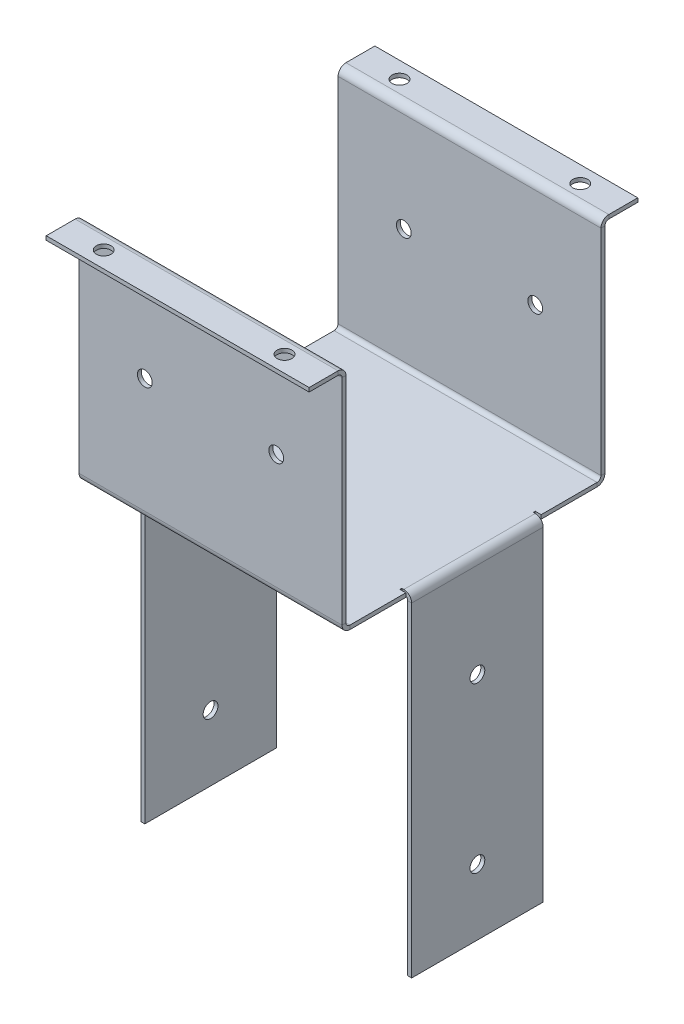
ISO-10303-21;
HEADER;
FILE_DESCRIPTION(('STEP AP214'),'2;1');
FILE_NAME('part.step','',(''),(''),'','','');
FILE_SCHEMA(('AUTOMOTIVE_DESIGN { 1 0 10303 214 1 1 1 1 }'));
ENDSEC;
DATA;
#1=APPLICATION_CONTEXT('core data for automotive mechanical design processes');
#2=APPLICATION_PROTOCOL_DEFINITION('international standard','automotive_design',2000,#1);
#3=PRODUCT_CONTEXT('',#1,'mechanical');
#4=PRODUCT('Part','Part','',(#3));
#5=PRODUCT_RELATED_PRODUCT_CATEGORY('part','',(#4));
#6=PRODUCT_DEFINITION_FORMATION('','',#4);
#7=PRODUCT_DEFINITION_CONTEXT('part definition',#1,'design');
#8=PRODUCT_DEFINITION('design','',#6,#7);
#9=PRODUCT_DEFINITION_SHAPE('','',#8);
#10=(LENGTH_UNIT() NAMED_UNIT(*) SI_UNIT(.MILLI.,.METRE.));
#11=(NAMED_UNIT(*) PLANE_ANGLE_UNIT() SI_UNIT($,.RADIAN.));
#12=(NAMED_UNIT(*) SI_UNIT($,.STERADIAN.) SOLID_ANGLE_UNIT());
#13=UNCERTAINTY_MEASURE_WITH_UNIT(LENGTH_MEASURE(1.E-05),#10,'distance_accuracy_value','');
#14=(GEOMETRIC_REPRESENTATION_CONTEXT(3) GLOBAL_UNCERTAINTY_ASSIGNED_CONTEXT((#13)) GLOBAL_UNIT_ASSIGNED_CONTEXT((#10,
#11,#12)) REPRESENTATION_CONTEXT('',''));
#15=CARTESIAN_POINT('',(0.,0.,0.));
#16=DIRECTION('',(0.,0.,1.));
#17=DIRECTION('',(1.,0.,0.));
#18=AXIS2_PLACEMENT_3D('',#15,#16,#17);
#19=CARTESIAN_POINT('',(0.,0.,50.8));
#20=DIRECTION('',(0.,0.,-1.));
#21=DIRECTION('',(-1.,0.,0.));
#22=AXIS2_PLACEMENT_3D('',#19,#20,#21);
#23=PLANE('',#22);
#24=CARTESIAN_POINT('',(-25.4,47.4980000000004,50.8));
#25=DIRECTION('',(0.,0.,-1.));
#26=DIRECTION('',(-1.,0.,0.));
#27=AXIS2_PLACEMENT_3D('',#24,#25,#26);
#28=CIRCLE('',#27,2.85749999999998);
#29=CARTESIAN_POINT('',(-28.2575,47.4980000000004,50.8));
#30=VERTEX_POINT('',#29);
#31=EDGE_CURVE('E895',#30,#30,#28,.F.);
#32=ORIENTED_EDGE('',*,*,#31,.F.);
#33=EDGE_LOOP('',(#32));
#34=FACE_BOUND('',#33,.T.);
#35=DIRECTION('',(-1.,0.,0.));
#36=VECTOR('',#35,1.);
#37=CARTESIAN_POINT('',(-50.8,85.852,50.8));
#38=LINE('',#37,#36);
#39=CARTESIAN_POINT('',(-50.8,85.852,50.8));
#40=VERTEX_POINT('',#39);
#41=CARTESIAN_POINT('',(50.8,85.852,50.8));
#42=VERTEX_POINT('',#41);
#43=EDGE_CURVE('E507',#40,#42,#38,.F.);
#44=ORIENTED_EDGE('',*,*,#43,.F.);
#45=DIRECTION('',(0.,-1.,0.));
#46=VECTOR('',#45,1.);
#47=CARTESIAN_POINT('',(-50.8,0.,50.8));
#48=LINE('',#47,#46);
#49=CARTESIAN_POINT('',(-50.8,3.048,50.8));
#50=VERTEX_POINT('',#49);
#51=EDGE_CURVE('E812',#40,#50,#48,.T.);
#52=ORIENTED_EDGE('',*,*,#51,.T.);
#53=DIRECTION('',(1.,0.,0.));
#54=VECTOR('',#53,1.);
#55=CARTESIAN_POINT('',(-50.8,3.048,50.8));
#56=LINE('',#55,#54);
#57=CARTESIAN_POINT('',(50.8,3.048,50.8));
#58=VERTEX_POINT('',#57);
#59=EDGE_CURVE('E823',#58,#50,#56,.F.);
#60=ORIENTED_EDGE('',*,*,#59,.F.);
#61=DIRECTION('',(0.,1.,0.));
#62=VECTOR('',#61,1.);
#63=CARTESIAN_POINT('',(50.8,0.,50.8));
#64=LINE('',#63,#62);
#65=EDGE_CURVE('E815',#58,#42,#64,.T.);
#66=ORIENTED_EDGE('',*,*,#65,.T.);
#67=EDGE_LOOP('',(#44,#52,#60,#66));
#68=FACE_BOUND('',#67,.T.);
#69=CARTESIAN_POINT('',(25.4,47.4980000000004,50.8));
#70=DIRECTION('',(0.,0.,-1.));
#71=DIRECTION('',(-1.,0.,0.));
#72=AXIS2_PLACEMENT_3D('',#69,#70,#71);
#73=CIRCLE('',#72,2.85749999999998);
#74=CARTESIAN_POINT('',(22.5425,47.4980000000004,50.8));
#75=VERTEX_POINT('',#74);
#76=EDGE_CURVE('E1933',#75,#75,#73,.F.);
#77=ORIENTED_EDGE('',*,*,#76,.F.);
#78=EDGE_LOOP('',(#77));
#79=FACE_BOUND('',#78,.T.);
#80=ADVANCED_FACE('F170',(#34,#68,#79),#23,.F.);
#81=CARTESIAN_POINT('',(50.8,88.9,50.8));
#82=DIRECTION('',(-1.,0.,0.));
#83=DIRECTION('',(0.,0.,1.));
#84=AXIS2_PLACEMENT_3D('',#81,#82,#83);
#85=PLANE('',#84);
#86=DIRECTION('',(0.,0.,-1.));
#87=VECTOR('',#86,1.);
#88=CARTESIAN_POINT('',(50.8,85.852,50.8));
#89=LINE('',#88,#87);
#90=CARTESIAN_POINT('',(50.8,85.852,49.276));
#91=VERTEX_POINT('',#90);
#92=EDGE_CURVE('E512',#42,#91,#89,.T.);
#93=ORIENTED_EDGE('',*,*,#92,.F.);
#94=ORIENTED_EDGE('',*,*,#65,.F.);
#95=DIRECTION('',(0.,0.,-1.));
#96=VECTOR('',#95,1.);
#97=CARTESIAN_POINT('',(50.8,3.048,49.276));
#98=LINE('',#97,#96);
#99=CARTESIAN_POINT('',(50.8,3.048,49.276));
#100=VERTEX_POINT('',#99);
#101=EDGE_CURVE('E826',#100,#58,#98,.F.);
#102=ORIENTED_EDGE('',*,*,#101,.F.);
#103=DIRECTION('',(0.,-1.,0.));
#104=VECTOR('',#103,1.);
#105=CARTESIAN_POINT('',(50.8,88.9,49.276));
#106=LINE('',#105,#104);
#107=EDGE_CURVE('E820',#100,#91,#106,.F.);
#108=ORIENTED_EDGE('',*,*,#107,.T.);
#109=EDGE_LOOP('',(#93,#94,#102,#108));
#110=FACE_BOUND('',#109,.T.);
#111=ADVANCED_FACE('F973',(#110),#85,.F.);
#112=CARTESIAN_POINT('',(-50.8,1.524,50.8));
#113=DIRECTION('',(1.,0.,0.));
#114=DIRECTION('',(0.,0.,-1.));
#115=AXIS2_PLACEMENT_3D('',#112,#113,#114);
#116=PLANE('',#115);
#117=DIRECTION('',(0.,0.,-1.));
#118=VECTOR('',#117,1.);
#119=CARTESIAN_POINT('',(-50.8,85.852,50.8));
#120=LINE('',#119,#118);
#121=CARTESIAN_POINT('',(-50.8,85.852,49.276));
#122=VERTEX_POINT('',#121);
#123=EDGE_CURVE('E501',#40,#122,#120,.T.);
#124=ORIENTED_EDGE('',*,*,#123,.T.);
#125=DIRECTION('',(0.,1.,0.));
#126=VECTOR('',#125,1.);
#127=CARTESIAN_POINT('',(-50.8,1.524,49.276));
#128=LINE('',#127,#126);
#129=CARTESIAN_POINT('',(-50.8,3.048,49.276));
#130=VERTEX_POINT('',#129);
#131=EDGE_CURVE('E818',#122,#130,#128,.F.);
#132=ORIENTED_EDGE('',*,*,#131,.T.);
#133=DIRECTION('',(0.,0.,-1.));
#134=VECTOR('',#133,1.);
#135=CARTESIAN_POINT('',(-50.8,3.048,50.8));
#136=LINE('',#135,#134);
#137=EDGE_CURVE('E809',#130,#50,#136,.F.);
#138=ORIENTED_EDGE('',*,*,#137,.T.);
#139=ORIENTED_EDGE('',*,*,#51,.F.);
#140=EDGE_LOOP('',(#124,#132,#138,#139));
#141=FACE_BOUND('',#140,.T.);
#142=ADVANCED_FACE('F979',(#141),#116,.F.);
#143=CARTESIAN_POINT('',(0.,0.,49.276));
#144=DIRECTION('',(0.,0.,-1.));
#145=DIRECTION('',(-1.,0.,0.));
#146=AXIS2_PLACEMENT_3D('',#143,#144,#145);
#147=PLANE('',#146);
#148=CARTESIAN_POINT('',(25.4,47.4980000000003,49.276));
#149=DIRECTION('',(0.,0.,-1.));
#150=DIRECTION('',(-1.,0.,0.));
#151=AXIS2_PLACEMENT_3D('',#148,#149,#150);
#152=CIRCLE('',#151,2.85749999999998);
#153=CARTESIAN_POINT('',(22.5425,47.4980000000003,49.276));
#154=VERTEX_POINT('',#153);
#155=EDGE_CURVE('E907',#154,#154,#152,.T.);
#156=ORIENTED_EDGE('',*,*,#155,.F.);
#157=EDGE_LOOP('',(#156));
#158=FACE_BOUND('',#157,.T.);
#159=CARTESIAN_POINT('',(-25.4,47.4980000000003,49.276));
#160=DIRECTION('',(0.,0.,-1.));
#161=DIRECTION('',(-1.,0.,0.));
#162=AXIS2_PLACEMENT_3D('',#159,#160,#161);
#163=CIRCLE('',#162,2.85749999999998);
#164=CARTESIAN_POINT('',(-28.2575,47.4980000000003,49.276));
#165=VERTEX_POINT('',#164);
#166=EDGE_CURVE('E894',#165,#165,#163,.T.);
#167=ORIENTED_EDGE('',*,*,#166,.F.);
#168=EDGE_LOOP('',(#167));
#169=FACE_BOUND('',#168,.T.);
#170=ORIENTED_EDGE('',*,*,#131,.F.);
#171=DIRECTION('',(-1.,0.,0.));
#172=VECTOR('',#171,1.);
#173=CARTESIAN_POINT('',(-50.8,85.852,49.276));
#174=LINE('',#173,#172);
#175=EDGE_CURVE('E496',#122,#91,#174,.F.);
#176=ORIENTED_EDGE('',*,*,#175,.T.);
#177=ORIENTED_EDGE('',*,*,#107,.F.);
#178=DIRECTION('',(1.,0.,0.));
#179=VECTOR('',#178,1.);
#180=CARTESIAN_POINT('',(-50.8,3.048,49.276));
#181=LINE('',#180,#179);
#182=EDGE_CURVE('E829',#130,#100,#181,.T.);
#183=ORIENTED_EDGE('',*,*,#182,.F.);
#184=EDGE_LOOP('',(#170,#176,#177,#183));
#185=FACE_BOUND('',#184,.T.);
#186=ADVANCED_FACE('F987',(#158,#169,#185),#147,.T.);
#187=CARTESIAN_POINT('',(-50.8,88.9,-50.8000000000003));
#188=DIRECTION('',(1.,0.,0.));
#189=DIRECTION('',(0.,0.,-1.));
#190=AXIS2_PLACEMENT_3D('',#187,#188,#189);
#191=PLANE('',#190);
#192=DIRECTION('',(0.,0.,1.));
#193=VECTOR('',#192,1.);
#194=CARTESIAN_POINT('',(-50.8,85.852,-50.8000000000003));
#195=LINE('',#194,#193);
#196=CARTESIAN_POINT('',(-50.8,85.852,-50.8000000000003));
#197=VERTEX_POINT('',#196);
#198=CARTESIAN_POINT('',(-50.8,85.852,-49.2760000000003));
#199=VERTEX_POINT('',#198);
#200=EDGE_CURVE('E562',#197,#199,#195,.T.);
#201=ORIENTED_EDGE('',*,*,#200,.F.);
#202=DIRECTION('',(0.,1.,0.));
#203=VECTOR('',#202,1.);
#204=CARTESIAN_POINT('',(-50.8,-1.82827605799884E-13,-50.8));
#205=LINE('',#204,#203);
#206=CARTESIAN_POINT('',(-50.8,3.04800000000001,-50.8));
#207=VERTEX_POINT('',#206);
#208=EDGE_CURVE('E770',#207,#197,#205,.T.);
#209=ORIENTED_EDGE('',*,*,#208,.F.);
#210=DIRECTION('',(0.,0.,1.));
#211=VECTOR('',#210,1.);
#212=CARTESIAN_POINT('',(-50.8,3.048,-49.276));
#213=LINE('',#212,#211);
#214=CARTESIAN_POINT('',(-50.8,3.04799999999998,-49.276));
#215=VERTEX_POINT('',#214);
#216=EDGE_CURVE('E781',#215,#207,#213,.F.);
#217=ORIENTED_EDGE('',*,*,#216,.F.);
#218=DIRECTION('',(0.,-1.,0.));
#219=VECTOR('',#218,1.);
#220=CARTESIAN_POINT('',(-50.8,88.9,-49.2760000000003));
#221=LINE('',#220,#219);
#222=EDGE_CURVE('E775',#215,#199,#221,.F.);
#223=ORIENTED_EDGE('',*,*,#222,.T.);
#224=EDGE_LOOP('',(#201,#209,#217,#223));
#225=FACE_BOUND('',#224,.T.);
#226=ADVANCED_FACE('F990',(#225),#191,.F.);
#227=CARTESIAN_POINT('',(50.8,1.52399999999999,-50.8));
#228=DIRECTION('',(-1.,0.,0.));
#229=DIRECTION('',(0.,0.,1.));
#230=AXIS2_PLACEMENT_3D('',#227,#228,#229);
#231=PLANE('',#230);
#232=DIRECTION('',(0.,0.,1.));
#233=VECTOR('',#232,1.);
#234=CARTESIAN_POINT('',(50.8,85.852,-50.8000000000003));
#235=LINE('',#234,#233);
#236=CARTESIAN_POINT('',(50.8,85.852,-50.8000000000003));
#237=VERTEX_POINT('',#236);
#238=CARTESIAN_POINT('',(50.8,85.852,-49.2760000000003));
#239=VERTEX_POINT('',#238);
#240=EDGE_CURVE('E552',#237,#239,#235,.T.);
#241=ORIENTED_EDGE('',*,*,#240,.T.);
#242=DIRECTION('',(0.,1.,0.));
#243=VECTOR('',#242,1.);
#244=CARTESIAN_POINT('',(50.8,1.524,-49.276));
#245=LINE('',#244,#243);
#246=CARTESIAN_POINT('',(50.8,3.04799999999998,-49.276));
#247=VERTEX_POINT('',#246);
#248=EDGE_CURVE('E773',#239,#247,#245,.F.);
#249=ORIENTED_EDGE('',*,*,#248,.T.);
#250=DIRECTION('',(0.,0.,1.));
#251=VECTOR('',#250,1.);
#252=CARTESIAN_POINT('',(50.8,3.04800000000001,-50.8));
#253=LINE('',#252,#251);
#254=CARTESIAN_POINT('',(50.8,3.04799999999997,-50.8));
#255=VERTEX_POINT('',#254);
#256=EDGE_CURVE('E766',#247,#255,#253,.F.);
#257=ORIENTED_EDGE('',*,*,#256,.T.);
#258=DIRECTION('',(0.,-1.,0.));
#259=VECTOR('',#258,1.);
#260=CARTESIAN_POINT('',(50.8,-1.82827605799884E-13,-50.8));
#261=LINE('',#260,#259);
#262=EDGE_CURVE('E767',#237,#255,#261,.T.);
#263=ORIENTED_EDGE('',*,*,#262,.F.);
#264=EDGE_LOOP('',(#241,#249,#257,#263));
#265=FACE_BOUND('',#264,.T.);
#266=ADVANCED_FACE('F1247',(#265),#231,.F.);
#267=CARTESIAN_POINT('',(0.,-1.82827605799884E-13,-50.8));
#268=DIRECTION('',(0.,0.,1.));
#269=DIRECTION('',(0.,-1.,0.));
#270=AXIS2_PLACEMENT_3D('',#267,#268,#269);
#271=PLANE('',#270);
#272=CARTESIAN_POINT('',(25.4,47.498,-50.8000000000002));
#273=DIRECTION('',(0.,0.,-1.));
#274=DIRECTION('',(0.,1.,0.));
#275=AXIS2_PLACEMENT_3D('',#272,#273,#274);
#276=CIRCLE('',#275,2.85749999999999);
#277=CARTESIAN_POINT('',(25.4,50.3555,-50.8000000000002));
#278=VERTEX_POINT('',#277);
#279=EDGE_CURVE('E1934',#278,#278,#276,.T.);
#280=ORIENTED_EDGE('',*,*,#279,.F.);
#281=EDGE_LOOP('',(#280));
#282=FACE_BOUND('',#281,.T.);
#283=CARTESIAN_POINT('',(-25.4,47.498,-50.8000000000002));
#284=DIRECTION('',(0.,0.,-1.));
#285=DIRECTION('',(0.,1.,0.));
#286=AXIS2_PLACEMENT_3D('',#283,#284,#285);
#287=CIRCLE('',#286,2.85749999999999);
#288=CARTESIAN_POINT('',(-25.4,50.3555,-50.8000000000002));
#289=VERTEX_POINT('',#288);
#290=EDGE_CURVE('E902',#289,#289,#287,.T.);
#291=ORIENTED_EDGE('',*,*,#290,.F.);
#292=EDGE_LOOP('',(#291));
#293=FACE_BOUND('',#292,.T.);
#294=DIRECTION('',(1.,0.,0.));
#295=VECTOR('',#294,1.);
#296=CARTESIAN_POINT('',(50.8,85.852,-50.8000000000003));
#297=LINE('',#296,#295);
#298=EDGE_CURVE('E558',#237,#197,#297,.F.);
#299=ORIENTED_EDGE('',*,*,#298,.F.);
#300=ORIENTED_EDGE('',*,*,#262,.T.);
#301=DIRECTION('',(-1.,0.,0.));
#302=VECTOR('',#301,1.);
#303=CARTESIAN_POINT('',(50.8,3.04800000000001,-50.8));
#304=LINE('',#303,#302);
#305=EDGE_CURVE('E778',#207,#255,#304,.F.);
#306=ORIENTED_EDGE('',*,*,#305,.F.);
#307=ORIENTED_EDGE('',*,*,#208,.T.);
#308=EDGE_LOOP('',(#299,#300,#306,#307));
#309=FACE_BOUND('',#308,.T.);
#310=ADVANCED_FACE('F1244',(#282,#293,#309),#271,.F.);
#311=CARTESIAN_POINT('',(0.,-1.77506588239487E-13,-49.276));
#312=DIRECTION('',(0.,0.,1.));
#313=DIRECTION('',(0.,-1.,0.));
#314=AXIS2_PLACEMENT_3D('',#311,#312,#313);
#315=PLANE('',#314);
#316=CARTESIAN_POINT('',(25.4,47.498,-49.2760000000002));
#317=DIRECTION('',(0.,0.,1.));
#318=DIRECTION('',(0.,-1.,0.));
#319=AXIS2_PLACEMENT_3D('',#316,#317,#318);
#320=CIRCLE('',#319,2.85749999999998);
#321=CARTESIAN_POINT('',(25.4,44.6405,-49.2760000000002));
#322=VERTEX_POINT('',#321);
#323=EDGE_CURVE('E174',#322,#322,#320,.T.);
#324=ORIENTED_EDGE('',*,*,#323,.F.);
#325=EDGE_LOOP('',(#324));
#326=FACE_BOUND('',#325,.T.);
#327=CARTESIAN_POINT('',(-25.4,47.498,-49.2760000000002));
#328=DIRECTION('',(0.,0.,1.));
#329=DIRECTION('',(0.,-1.,0.));
#330=AXIS2_PLACEMENT_3D('',#327,#328,#329);
#331=CIRCLE('',#330,2.85749999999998);
#332=CARTESIAN_POINT('',(-25.4,44.6405,-49.2760000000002));
#333=VERTEX_POINT('',#332);
#334=EDGE_CURVE('E892',#333,#333,#331,.T.);
#335=ORIENTED_EDGE('',*,*,#334,.F.);
#336=EDGE_LOOP('',(#335));
#337=FACE_BOUND('',#336,.T.);
#338=ORIENTED_EDGE('',*,*,#248,.F.);
#339=DIRECTION('',(1.,0.,0.));
#340=VECTOR('',#339,1.);
#341=CARTESIAN_POINT('',(50.8,85.852,-49.2760000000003));
#342=LINE('',#341,#340);
#343=EDGE_CURVE('E547',#239,#199,#342,.F.);
#344=ORIENTED_EDGE('',*,*,#343,.T.);
#345=ORIENTED_EDGE('',*,*,#222,.F.);
#346=DIRECTION('',(-1.,0.,0.));
#347=VECTOR('',#346,1.);
#348=CARTESIAN_POINT('',(50.8,3.048,-49.276));
#349=LINE('',#348,#347);
#350=EDGE_CURVE('E784',#247,#215,#349,.T.);
#351=ORIENTED_EDGE('',*,*,#350,.F.);
#352=EDGE_LOOP('',(#338,#344,#345,#351));
#353=FACE_BOUND('',#352,.T.);
#354=ADVANCED_FACE('F1017',(#326,#337,#353),#315,.T.);
#355=CARTESIAN_POINT('',(0.,1.524,0.));
#356=DIRECTION('',(0.,-1.,0.));
#357=DIRECTION('',(0.,0.,-1.));
#358=AXIS2_PLACEMENT_3D('',#355,#356,#357);
#359=PLANE('',#358);
#360=DIRECTION('',(-1.,0.,0.));
#361=VECTOR('',#360,1.);
#362=CARTESIAN_POINT('',(0.,1.524,-26.162));
#363=LINE('',#362,#361);
#364=CARTESIAN_POINT('',(-48.514,1.524,-26.162));
#365=VERTEX_POINT('',#364);
#366=CARTESIAN_POINT('',(-50.8,1.524,-26.162));
#367=VERTEX_POINT('',#366);
#368=EDGE_CURVE('E703',#365,#367,#363,.T.);
#369=ORIENTED_EDGE('',*,*,#368,.F.);
#370=DIRECTION('',(0.,0.,-1.));
#371=VECTOR('',#370,1.);
#372=CARTESIAN_POINT('',(-48.514,1.524,0.));
#373=LINE('',#372,#371);
#374=CARTESIAN_POINT('',(-48.514,1.524,-25.4));
#375=VERTEX_POINT('',#374);
#376=EDGE_CURVE('E715',#375,#365,#373,.T.);
#377=ORIENTED_EDGE('',*,*,#376,.F.);
#378=DIRECTION('',(1.,0.,0.));
#379=VECTOR('',#378,1.);
#380=CARTESIAN_POINT('',(0.,1.524,-25.4));
#381=LINE('',#380,#379);
#382=CARTESIAN_POINT('',(-49.276,1.52399999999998,-25.4));
#383=VERTEX_POINT('',#382);
#384=EDGE_CURVE('E712',#383,#375,#381,.T.);
#385=ORIENTED_EDGE('',*,*,#384,.F.);
#386=DIRECTION('',(0.,0.,-1.));
#387=VECTOR('',#386,1.);
#388=CARTESIAN_POINT('',(-49.276,1.52399999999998,-25.4));
#389=LINE('',#388,#387);
#390=CARTESIAN_POINT('',(-49.276,1.524,25.4));
#391=VERTEX_POINT('',#390);
#392=EDGE_CURVE('E597',#383,#391,#389,.F.);
#393=ORIENTED_EDGE('',*,*,#392,.T.);
#394=DIRECTION('',(-1.,0.,0.));
#395=VECTOR('',#394,1.);
#396=CARTESIAN_POINT('',(0.,1.524,25.4));
#397=LINE('',#396,#395);
#398=CARTESIAN_POINT('',(-48.514,1.524,25.4));
#399=VERTEX_POINT('',#398);
#400=EDGE_CURVE('E709',#399,#391,#397,.T.);
#401=ORIENTED_EDGE('',*,*,#400,.F.);
#402=DIRECTION('',(0.,0.,-1.));
#403=VECTOR('',#402,1.);
#404=CARTESIAN_POINT('',(-48.514,1.524,0.));
#405=LINE('',#404,#403);
#406=CARTESIAN_POINT('',(-48.514,1.524,26.162));
#407=VERTEX_POINT('',#406);
#408=EDGE_CURVE('E706',#407,#399,#405,.T.);
#409=ORIENTED_EDGE('',*,*,#408,.F.);
#410=DIRECTION('',(1.,0.,0.));
#411=VECTOR('',#410,1.);
#412=CARTESIAN_POINT('',(0.,1.524,26.162));
#413=LINE('',#412,#411);
#414=CARTESIAN_POINT('',(-50.8,1.524,26.162));
#415=VERTEX_POINT('',#414);
#416=EDGE_CURVE('E674',#415,#407,#413,.T.);
#417=ORIENTED_EDGE('',*,*,#416,.F.);
#418=DIRECTION('',(0.,0.,1.));
#419=VECTOR('',#418,1.);
#420=CARTESIAN_POINT('',(-50.8,1.524,50.8));
#421=LINE('',#420,#419);
#422=CARTESIAN_POINT('',(-50.8,1.524,47.752));
#423=VERTEX_POINT('',#422);
#424=EDGE_CURVE('E863',#415,#423,#421,.T.);
#425=ORIENTED_EDGE('',*,*,#424,.T.);
#426=DIRECTION('',(1.,0.,0.));
#427=VECTOR('',#426,1.);
#428=CARTESIAN_POINT('',(50.8,1.524,47.752));
#429=LINE('',#428,#427);
#430=CARTESIAN_POINT('',(50.8,1.524,47.752));
#431=VERTEX_POINT('',#430);
#432=EDGE_CURVE('E846',#431,#423,#429,.F.);
#433=ORIENTED_EDGE('',*,*,#432,.F.);
#434=DIRECTION('',(0.,0.,-1.));
#435=VECTOR('',#434,1.);
#436=CARTESIAN_POINT('',(50.8,1.524,50.8));
#437=LINE('',#436,#435);
#438=CARTESIAN_POINT('',(50.8,1.524,26.162));
#439=VERTEX_POINT('',#438);
#440=EDGE_CURVE('E865',#431,#439,#437,.T.);
#441=ORIENTED_EDGE('',*,*,#440,.T.);
#442=DIRECTION('',(1.,0.,0.));
#443=VECTOR('',#442,1.);
#444=CARTESIAN_POINT('',(0.,1.524,26.162));
#445=LINE('',#444,#443);
#446=CARTESIAN_POINT('',(48.514,1.524,26.162));
#447=VERTEX_POINT('',#446);
#448=EDGE_CURVE('E722',#447,#439,#445,.T.);
#449=ORIENTED_EDGE('',*,*,#448,.F.);
#450=DIRECTION('',(0.,0.,1.));
#451=VECTOR('',#450,1.);
#452=CARTESIAN_POINT('',(48.514,1.524,0.));
#453=LINE('',#452,#451);
#454=CARTESIAN_POINT('',(48.514,1.524,25.4));
#455=VERTEX_POINT('',#454);
#456=EDGE_CURVE('E763',#455,#447,#453,.T.);
#457=ORIENTED_EDGE('',*,*,#456,.F.);
#458=DIRECTION('',(-1.,0.,0.));
#459=VECTOR('',#458,1.);
#460=CARTESIAN_POINT('',(0.,1.524,25.4));
#461=LINE('',#460,#459);
#462=CARTESIAN_POINT('',(49.276,1.52399999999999,25.4));
#463=VERTEX_POINT('',#462);
#464=EDGE_CURVE('E760',#463,#455,#461,.T.);
#465=ORIENTED_EDGE('',*,*,#464,.F.);
#466=DIRECTION('',(0.,0.,1.));
#467=VECTOR('',#466,1.);
#468=CARTESIAN_POINT('',(49.276,1.52399999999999,25.4));
#469=LINE('',#468,#467);
#470=CARTESIAN_POINT('',(49.276,1.524,-25.4));
#471=VERTEX_POINT('',#470);
#472=EDGE_CURVE('E649',#463,#471,#469,.F.);
#473=ORIENTED_EDGE('',*,*,#472,.T.);
#474=DIRECTION('',(1.,0.,0.));
#475=VECTOR('',#474,1.);
#476=CARTESIAN_POINT('',(0.,1.524,-25.4));
#477=LINE('',#476,#475);
#478=CARTESIAN_POINT('',(48.514,1.524,-25.4));
#479=VERTEX_POINT('',#478);
#480=EDGE_CURVE('E757',#479,#471,#477,.T.);
#481=ORIENTED_EDGE('',*,*,#480,.F.);
#482=DIRECTION('',(0.,0.,1.));
#483=VECTOR('',#482,1.);
#484=CARTESIAN_POINT('',(48.514,1.524,0.));
#485=LINE('',#484,#483);
#486=CARTESIAN_POINT('',(48.514,1.524,-26.162));
#487=VERTEX_POINT('',#486);
#488=EDGE_CURVE('E754',#487,#479,#485,.T.);
#489=ORIENTED_EDGE('',*,*,#488,.F.);
#490=DIRECTION('',(-1.,0.,0.));
#491=VECTOR('',#490,1.);
#492=CARTESIAN_POINT('',(0.,1.524,-26.162));
#493=LINE('',#492,#491);
#494=CARTESIAN_POINT('',(50.8,1.524,-26.162));
#495=VERTEX_POINT('',#494);
#496=EDGE_CURVE('E751',#495,#487,#493,.T.);
#497=ORIENTED_EDGE('',*,*,#496,.F.);
#498=DIRECTION('',(0.,0.,-1.));
#499=VECTOR('',#498,1.);
#500=CARTESIAN_POINT('',(50.8,1.524,-25.4));
#501=LINE('',#500,#499);
#502=CARTESIAN_POINT('',(50.8,1.52399999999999,-47.752));
#503=VERTEX_POINT('',#502);
#504=EDGE_CURVE('E857',#495,#503,#501,.T.);
#505=ORIENTED_EDGE('',*,*,#504,.T.);
#506=DIRECTION('',(-1.,0.,0.));
#507=VECTOR('',#506,1.);
#508=CARTESIAN_POINT('',(-50.8,1.52399999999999,-47.752));
#509=LINE('',#508,#507);
#510=CARTESIAN_POINT('',(-50.8,1.52399999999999,-47.752));
#511=VERTEX_POINT('',#510);
#512=EDGE_CURVE('E801',#511,#503,#509,.F.);
#513=ORIENTED_EDGE('',*,*,#512,.F.);
#514=DIRECTION('',(0.,0.,1.));
#515=VECTOR('',#514,1.);
#516=CARTESIAN_POINT('',(-50.8,1.524,-25.4));
#517=LINE('',#516,#515);
#518=EDGE_CURVE('E859',#511,#367,#517,.T.);
#519=ORIENTED_EDGE('',*,*,#518,.T.);
#520=EDGE_LOOP('',(#369,#377,#385,#393,#401,#409,#417,#425,#433,#441,#449,#457,#465,#473,#481,
#489,#497,#505,#513,#519));
#521=FACE_BOUND('',#520,.T.);
#522=ADVANCED_FACE('F1013',(#521),#359,.F.);
#523=CARTESIAN_POINT('',(0.,0.,0.));
#524=DIRECTION('',(0.,-1.,0.));
#525=DIRECTION('',(0.,0.,-1.));
#526=AXIS2_PLACEMENT_3D('',#523,#524,#525);
#527=PLANE('',#526);
#528=DIRECTION('',(0.,0.,1.));
#529=VECTOR('',#528,1.);
#530=CARTESIAN_POINT('',(-48.514,0.,-26.162));
#531=LINE('',#530,#529);
#532=CARTESIAN_POINT('',(-48.514,0.,-26.162));
#533=VERTEX_POINT('',#532);
#534=CARTESIAN_POINT('',(-48.514,0.,-25.4));
#535=VERTEX_POINT('',#534);
#536=EDGE_CURVE('E675',#533,#535,#531,.T.);
#537=ORIENTED_EDGE('',*,*,#536,.F.);
#538=DIRECTION('',(1.,0.,0.));
#539=VECTOR('',#538,1.);
#540=CARTESIAN_POINT('',(-52.324,0.,-26.162));
#541=LINE('',#540,#539);
#542=CARTESIAN_POINT('',(-50.8,0.,-26.162));
#543=VERTEX_POINT('',#542);
#544=EDGE_CURVE('E671',#543,#533,#541,.T.);
#545=ORIENTED_EDGE('',*,*,#544,.F.);
#546=DIRECTION('',(0.,0.,1.));
#547=VECTOR('',#546,1.);
#548=CARTESIAN_POINT('',(-50.8,0.,-25.4));
#549=LINE('',#548,#547);
#550=CARTESIAN_POINT('',(-50.8,0.,-47.752));
#551=VERTEX_POINT('',#550);
#552=EDGE_CURVE('E870',#551,#543,#549,.T.);
#553=ORIENTED_EDGE('',*,*,#552,.F.);
#554=DIRECTION('',(-1.,0.,0.));
#555=VECTOR('',#554,1.);
#556=CARTESIAN_POINT('',(-50.8,0.,-47.752));
#557=LINE('',#556,#555);
#558=CARTESIAN_POINT('',(50.8,0.,-47.752));
#559=VERTEX_POINT('',#558);
#560=EDGE_CURVE('E788',#551,#559,#557,.F.);
#561=ORIENTED_EDGE('',*,*,#560,.T.);
#562=DIRECTION('',(0.,0.,-1.));
#563=VECTOR('',#562,1.);
#564=CARTESIAN_POINT('',(50.8,0.,-25.4));
#565=LINE('',#564,#563);
#566=CARTESIAN_POINT('',(50.8,0.,-26.162));
#567=VERTEX_POINT('',#566);
#568=EDGE_CURVE('E854',#567,#559,#565,.T.);
#569=ORIENTED_EDGE('',*,*,#568,.F.);
#570=DIRECTION('',(1.,0.,0.));
#571=VECTOR('',#570,1.);
#572=CARTESIAN_POINT('',(48.514,0.,-26.162));
#573=LINE('',#572,#571);
#574=CARTESIAN_POINT('',(48.514,0.,-26.162));
#575=VERTEX_POINT('',#574);
#576=EDGE_CURVE('E738',#575,#567,#573,.T.);
#577=ORIENTED_EDGE('',*,*,#576,.F.);
#578=DIRECTION('',(0.,0.,-1.));
#579=VECTOR('',#578,1.);
#580=CARTESIAN_POINT('',(48.514,0.,-25.4));
#581=LINE('',#580,#579);
#582=CARTESIAN_POINT('',(48.514,0.,-25.4));
#583=VERTEX_POINT('',#582);
#584=EDGE_CURVE('E734',#583,#575,#581,.T.);
#585=ORIENTED_EDGE('',*,*,#584,.F.);
#586=DIRECTION('',(-1.,0.,0.));
#587=VECTOR('',#586,1.);
#588=CARTESIAN_POINT('',(49.276,0.,-25.4));
#589=LINE('',#588,#587);
#590=CARTESIAN_POINT('',(49.276,0.,-25.4));
#591=VERTEX_POINT('',#590);
#592=EDGE_CURVE('E731',#591,#583,#589,.T.);
#593=ORIENTED_EDGE('',*,*,#592,.F.);
#594=DIRECTION('',(0.,0.,1.));
#595=VECTOR('',#594,1.);
#596=CARTESIAN_POINT('',(49.276,0.,25.4));
#597=LINE('',#596,#595);
#598=CARTESIAN_POINT('',(49.276,0.,25.4));
#599=VERTEX_POINT('',#598);
#600=EDGE_CURVE('E661',#599,#591,#597,.F.);
#601=ORIENTED_EDGE('',*,*,#600,.F.);
#602=DIRECTION('',(1.,0.,0.));
#603=VECTOR('',#602,1.);
#604=CARTESIAN_POINT('',(48.514,0.,25.4));
#605=LINE('',#604,#603);
#606=CARTESIAN_POINT('',(48.514,0.,25.4));
#607=VERTEX_POINT('',#606);
#608=EDGE_CURVE('E727',#607,#599,#605,.T.);
#609=ORIENTED_EDGE('',*,*,#608,.F.);
#610=DIRECTION('',(0.,0.,-1.));
#611=VECTOR('',#610,1.);
#612=CARTESIAN_POINT('',(48.514,0.,26.162));
#613=LINE('',#612,#611);
#614=CARTESIAN_POINT('',(48.514,0.,26.162));
#615=VERTEX_POINT('',#614);
#616=EDGE_CURVE('E723',#615,#607,#613,.T.);
#617=ORIENTED_EDGE('',*,*,#616,.F.);
#618=DIRECTION('',(-1.,0.,0.));
#619=VECTOR('',#618,1.);
#620=CARTESIAN_POINT('',(52.324,0.,26.162));
#621=LINE('',#620,#619);
#622=CARTESIAN_POINT('',(50.8,0.,26.162));
#623=VERTEX_POINT('',#622);
#624=EDGE_CURVE('E719',#623,#615,#621,.T.);
#625=ORIENTED_EDGE('',*,*,#624,.F.);
#626=DIRECTION('',(0.,0.,-1.));
#627=VECTOR('',#626,1.);
#628=CARTESIAN_POINT('',(50.8,0.,50.8));
#629=LINE('',#628,#627);
#630=CARTESIAN_POINT('',(50.8,0.,47.752));
#631=VERTEX_POINT('',#630);
#632=EDGE_CURVE('E860',#631,#623,#629,.T.);
#633=ORIENTED_EDGE('',*,*,#632,.F.);
#634=DIRECTION('',(1.,0.,0.));
#635=VECTOR('',#634,1.);
#636=CARTESIAN_POINT('',(50.8,0.,47.752));
#637=LINE('',#636,#635);
#638=CARTESIAN_POINT('',(-50.8,0.,47.752));
#639=VERTEX_POINT('',#638);
#640=EDGE_CURVE('E833',#631,#639,#637,.F.);
#641=ORIENTED_EDGE('',*,*,#640,.T.);
#642=DIRECTION('',(0.,0.,1.));
#643=VECTOR('',#642,1.);
#644=CARTESIAN_POINT('',(-50.8,0.,50.8));
#645=LINE('',#644,#643);
#646=CARTESIAN_POINT('',(-50.8,0.,26.162));
#647=VERTEX_POINT('',#646);
#648=EDGE_CURVE('E873',#647,#639,#645,.T.);
#649=ORIENTED_EDGE('',*,*,#648,.F.);
#650=DIRECTION('',(-1.,0.,0.));
#651=VECTOR('',#650,1.);
#652=CARTESIAN_POINT('',(-48.514,0.,26.162));
#653=LINE('',#652,#651);
#654=CARTESIAN_POINT('',(-48.514,0.,26.162));
#655=VERTEX_POINT('',#654);
#656=EDGE_CURVE('E690',#655,#647,#653,.T.);
#657=ORIENTED_EDGE('',*,*,#656,.F.);
#658=DIRECTION('',(0.,0.,1.));
#659=VECTOR('',#658,1.);
#660=CARTESIAN_POINT('',(-48.514,0.,25.4));
#661=LINE('',#660,#659);
#662=CARTESIAN_POINT('',(-48.514,0.,25.4));
#663=VERTEX_POINT('',#662);
#664=EDGE_CURVE('E686',#663,#655,#661,.T.);
#665=ORIENTED_EDGE('',*,*,#664,.F.);
#666=DIRECTION('',(1.,0.,0.));
#667=VECTOR('',#666,1.);
#668=CARTESIAN_POINT('',(-49.276,0.,25.4));
#669=LINE('',#668,#667);
#670=CARTESIAN_POINT('',(-49.276,0.,25.4));
#671=VERTEX_POINT('',#670);
#672=EDGE_CURVE('E683',#671,#663,#669,.T.);
#673=ORIENTED_EDGE('',*,*,#672,.F.);
#674=DIRECTION('',(0.,0.,-1.));
#675=VECTOR('',#674,1.);
#676=CARTESIAN_POINT('',(-49.276,0.,-25.4));
#677=LINE('',#676,#675);
#678=CARTESIAN_POINT('',(-49.276,0.,-25.4));
#679=VERTEX_POINT('',#678);
#680=EDGE_CURVE('E609',#679,#671,#677,.F.);
#681=ORIENTED_EDGE('',*,*,#680,.F.);
#682=DIRECTION('',(-1.,0.,0.));
#683=VECTOR('',#682,1.);
#684=CARTESIAN_POINT('',(-48.514,0.,-25.4));
#685=LINE('',#684,#683);
#686=EDGE_CURVE('E679',#535,#679,#685,.T.);
#687=ORIENTED_EDGE('',*,*,#686,.F.);
#688=EDGE_LOOP('',(#537,#545,#553,#561,#569,#577,#585,#593,#601,#609,#617,#625,#633,#641,#649,
#657,#665,#673,#681,#687));
#689=FACE_BOUND('',#688,.T.);
#690=ADVANCED_FACE('F1016',(#689),#527,.T.);
#691=CARTESIAN_POINT('',(-50.8,1.524,-25.4));
#692=DIRECTION('',(1.,0.,0.));
#693=DIRECTION('',(0.,0.,-1.));
#694=AXIS2_PLACEMENT_3D('',#691,#692,#693);
#695=PLANE('',#694);
#696=DIRECTION('',(0.,-1.,0.));
#697=VECTOR('',#696,1.);
#698=CARTESIAN_POINT('',(-50.8,1.524,-26.162));
#699=LINE('',#698,#697);
#700=EDGE_CURVE('E15',#367,#543,#699,.T.);
#701=ORIENTED_EDGE('',*,*,#700,.F.);
#702=ORIENTED_EDGE('',*,*,#518,.F.);
#703=DIRECTION('',(0.,-1.,0.));
#704=VECTOR('',#703,1.);
#705=CARTESIAN_POINT('',(-50.8,1.52399999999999,-47.752));
#706=LINE('',#705,#704);
#707=EDGE_CURVE('E795',#511,#551,#706,.T.);
#708=ORIENTED_EDGE('',*,*,#707,.T.);
#709=ORIENTED_EDGE('',*,*,#552,.T.);
#710=EDGE_LOOP('',(#701,#702,#708,#709));
#711=FACE_BOUND('',#710,.T.);
#712=ADVANCED_FACE('F1021',(#711),#695,.F.);
#713=CARTESIAN_POINT('',(-50.8,1.524,50.8));
#714=DIRECTION('',(1.,0.,0.));
#715=DIRECTION('',(0.,0.,-1.));
#716=AXIS2_PLACEMENT_3D('',#713,#714,#715);
#717=PLANE('',#716);
#718=DIRECTION('',(0.,1.,0.));
#719=VECTOR('',#718,1.);
#720=CARTESIAN_POINT('',(-50.8,1.524,26.162));
#721=LINE('',#720,#719);
#722=EDGE_CURVE('E179',#647,#415,#721,.T.);
#723=ORIENTED_EDGE('',*,*,#722,.F.);
#724=ORIENTED_EDGE('',*,*,#648,.T.);
#725=DIRECTION('',(0.,-1.,0.));
#726=VECTOR('',#725,1.);
#727=CARTESIAN_POINT('',(-50.8,1.524,47.752));
#728=LINE('',#727,#726);
#729=EDGE_CURVE('E851',#423,#639,#728,.T.);
#730=ORIENTED_EDGE('',*,*,#729,.F.);
#731=ORIENTED_EDGE('',*,*,#424,.F.);
#732=EDGE_LOOP('',(#723,#724,#730,#731));
#733=FACE_BOUND('',#732,.T.);
#734=ADVANCED_FACE('F1026',(#733),#717,.F.);
#735=CARTESIAN_POINT('',(50.8,1.524,-25.4));
#736=DIRECTION('',(-1.,0.,0.));
#737=DIRECTION('',(0.,0.,1.));
#738=AXIS2_PLACEMENT_3D('',#735,#736,#737);
#739=PLANE('',#738);
#740=DIRECTION('',(0.,1.,0.));
#741=VECTOR('',#740,1.);
#742=CARTESIAN_POINT('',(50.8,1.524,-26.162));
#743=LINE('',#742,#741);
#744=EDGE_CURVE('E878',#567,#495,#743,.T.);
#745=ORIENTED_EDGE('',*,*,#744,.F.);
#746=ORIENTED_EDGE('',*,*,#568,.T.);
#747=DIRECTION('',(0.,-1.,0.));
#748=VECTOR('',#747,1.);
#749=CARTESIAN_POINT('',(50.8,1.52399999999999,-47.752));
#750=LINE('',#749,#748);
#751=EDGE_CURVE('E806',#503,#559,#750,.T.);
#752=ORIENTED_EDGE('',*,*,#751,.F.);
#753=ORIENTED_EDGE('',*,*,#504,.F.);
#754=EDGE_LOOP('',(#745,#746,#752,#753));
#755=FACE_BOUND('',#754,.T.);
#756=ADVANCED_FACE('F172',(#755),#739,.F.);
#757=CARTESIAN_POINT('',(50.8,1.524,50.8));
#758=DIRECTION('',(-1.,0.,0.));
#759=DIRECTION('',(0.,0.,1.));
#760=AXIS2_PLACEMENT_3D('',#757,#758,#759);
#761=PLANE('',#760);
#762=DIRECTION('',(0.,-1.,0.));
#763=VECTOR('',#762,1.);
#764=CARTESIAN_POINT('',(50.8,1.524,26.162));
#765=LINE('',#764,#763);
#766=EDGE_CURVE('E868',#439,#623,#765,.T.);
#767=ORIENTED_EDGE('',*,*,#766,.F.);
#768=ORIENTED_EDGE('',*,*,#440,.F.);
#769=DIRECTION('',(0.,-1.,0.));
#770=VECTOR('',#769,1.);
#771=CARTESIAN_POINT('',(50.8,1.524,47.752));
#772=LINE('',#771,#770);
#773=EDGE_CURVE('E840',#431,#631,#772,.T.);
#774=ORIENTED_EDGE('',*,*,#773,.T.);
#775=ORIENTED_EDGE('',*,*,#632,.T.);
#776=EDGE_LOOP('',(#767,#768,#774,#775));
#777=FACE_BOUND('',#776,.T.);
#778=ADVANCED_FACE('F1008',(#777),#761,.F.);
#779=CARTESIAN_POINT('',(-50.8,3.048,47.752));
#780=DIRECTION('',(-1.,0.,0.));
#781=DIRECTION('',(0.,0.,1.));
#782=AXIS2_PLACEMENT_3D('',#779,#780,#781);
#783=PLANE('',#782);
#784=ORIENTED_EDGE('',*,*,#137,.F.);
#785=CARTESIAN_POINT('',(-50.8,3.048,47.752));
#786=DIRECTION('',(1.,0.,0.));
#787=DIRECTION('',(0.,0.,-1.));
#788=AXIS2_PLACEMENT_3D('',#785,#786,#787);
#789=CIRCLE('',#788,1.524);
#790=EDGE_CURVE('E843',#423,#130,#789,.F.);
#791=ORIENTED_EDGE('',*,*,#790,.F.);
#792=ORIENTED_EDGE('',*,*,#729,.T.);
#793=CARTESIAN_POINT('',(-50.8,3.048,47.752));
#794=DIRECTION('',(1.,0.,0.));
#795=DIRECTION('',(0.,0.,-1.));
#796=AXIS2_PLACEMENT_3D('',#793,#794,#795);
#797=CIRCLE('',#796,3.048);
#798=EDGE_CURVE('E836',#639,#50,#797,.F.);
#799=ORIENTED_EDGE('',*,*,#798,.T.);
#800=EDGE_LOOP('',(#784,#791,#792,#799));
#801=FACE_BOUND('',#800,.T.);
#802=ADVANCED_FACE('F1005',(#801),#783,.T.);
#803=CARTESIAN_POINT('',(50.8,3.048,47.752));
#804=DIRECTION('',(-1.,0.,0.));
#805=DIRECTION('',(0.,0.,1.));
#806=AXIS2_PLACEMENT_3D('',#803,#804,#805);
#807=PLANE('',#806);
#808=CARTESIAN_POINT('',(50.8,3.048,47.752));
#809=DIRECTION('',(1.,0.,0.));
#810=DIRECTION('',(0.,0.,-1.));
#811=AXIS2_PLACEMENT_3D('',#808,#809,#810);
#812=CIRCLE('',#811,1.524);
#813=EDGE_CURVE('E814',#100,#431,#812,.T.);
#814=ORIENTED_EDGE('',*,*,#813,.F.);
#815=ORIENTED_EDGE('',*,*,#101,.T.);
#816=CARTESIAN_POINT('',(50.8,3.048,47.752));
#817=DIRECTION('',(1.,0.,0.));
#818=DIRECTION('',(0.,0.,-1.));
#819=AXIS2_PLACEMENT_3D('',#816,#817,#818);
#820=CIRCLE('',#819,3.048);
#821=EDGE_CURVE('E837',#58,#631,#820,.T.);
#822=ORIENTED_EDGE('',*,*,#821,.T.);
#823=ORIENTED_EDGE('',*,*,#773,.F.);
#824=EDGE_LOOP('',(#814,#815,#822,#823));
#825=FACE_BOUND('',#824,.T.);
#826=ADVANCED_FACE('F999',(#825),#807,.F.);
#827=CARTESIAN_POINT('',(50.8,3.048,47.752));
#828=DIRECTION('',(1.,0.,0.));
#829=DIRECTION('',(0.,0.,1.));
#830=AXIS2_PLACEMENT_3D('',#827,#828,#829);
#831=CYLINDRICAL_SURFACE('',#830,3.048);
#832=ORIENTED_EDGE('',*,*,#640,.F.);
#833=ORIENTED_EDGE('',*,*,#821,.F.);
#834=ORIENTED_EDGE('',*,*,#59,.T.);
#835=ORIENTED_EDGE('',*,*,#798,.F.);
#836=EDGE_LOOP('',(#832,#833,#834,#835));
#837=FACE_BOUND('',#836,.T.);
#838=ADVANCED_FACE('F995',(#837),#831,.T.);
#839=CARTESIAN_POINT('',(50.8,3.048,47.752));
#840=DIRECTION('',(1.,0.,0.));
#841=DIRECTION('',(0.,0.,1.));
#842=AXIS2_PLACEMENT_3D('',#839,#840,#841);
#843=CYLINDRICAL_SURFACE('',#842,1.524);
#844=ORIENTED_EDGE('',*,*,#432,.T.);
#845=ORIENTED_EDGE('',*,*,#790,.T.);
#846=ORIENTED_EDGE('',*,*,#182,.T.);
#847=ORIENTED_EDGE('',*,*,#813,.T.);
#848=EDGE_LOOP('',(#844,#845,#846,#847));
#849=FACE_BOUND('',#848,.T.);
#850=ADVANCED_FACE('F998',(#849),#843,.F.);
#851=CARTESIAN_POINT('',(50.8,3.04799999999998,-47.752));
#852=DIRECTION('',(1.,0.,0.));
#853=DIRECTION('',(0.,0.,-1.));
#854=AXIS2_PLACEMENT_3D('',#851,#852,#853);
#855=PLANE('',#854);
#856=ORIENTED_EDGE('',*,*,#256,.F.);
#857=CARTESIAN_POINT('',(50.8,3.04799999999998,-47.752));
#858=DIRECTION('',(-1.,0.,0.));
#859=DIRECTION('',(0.,0.,1.));
#860=AXIS2_PLACEMENT_3D('',#857,#858,#859);
#861=CIRCLE('',#860,1.524);
#862=EDGE_CURVE('E798',#503,#247,#861,.F.);
#863=ORIENTED_EDGE('',*,*,#862,.F.);
#864=ORIENTED_EDGE('',*,*,#751,.T.);
#865=CARTESIAN_POINT('',(50.8,3.04799999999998,-47.752));
#866=DIRECTION('',(-1.,0.,0.));
#867=DIRECTION('',(0.,0.,1.));
#868=AXIS2_PLACEMENT_3D('',#865,#866,#867);
#869=CIRCLE('',#868,3.048);
#870=EDGE_CURVE('E791',#559,#255,#869,.F.);
#871=ORIENTED_EDGE('',*,*,#870,.T.);
#872=EDGE_LOOP('',(#856,#863,#864,#871));
#873=FACE_BOUND('',#872,.T.);
#874=ADVANCED_FACE('F1003',(#873),#855,.T.);
#875=CARTESIAN_POINT('',(-50.8,3.04799999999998,-47.752));
#876=DIRECTION('',(1.,0.,0.));
#877=DIRECTION('',(0.,0.,-1.));
#878=AXIS2_PLACEMENT_3D('',#875,#876,#877);
#879=PLANE('',#878);
#880=CARTESIAN_POINT('',(-50.8,3.04799999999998,-47.752));
#881=DIRECTION('',(-1.,0.,0.));
#882=DIRECTION('',(0.,0.,1.));
#883=AXIS2_PLACEMENT_3D('',#880,#881,#882);
#884=CIRCLE('',#883,1.524);
#885=EDGE_CURVE('E769',#215,#511,#884,.T.);
#886=ORIENTED_EDGE('',*,*,#885,.F.);
#887=ORIENTED_EDGE('',*,*,#216,.T.);
#888=CARTESIAN_POINT('',(-50.8,3.04799999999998,-47.752));
#889=DIRECTION('',(-1.,0.,0.));
#890=DIRECTION('',(0.,0.,1.));
#891=AXIS2_PLACEMENT_3D('',#888,#889,#890);
#892=CIRCLE('',#891,3.048);
#893=EDGE_CURVE('E792',#207,#551,#892,.T.);
#894=ORIENTED_EDGE('',*,*,#893,.T.);
#895=ORIENTED_EDGE('',*,*,#707,.F.);
#896=EDGE_LOOP('',(#886,#887,#894,#895));
#897=FACE_BOUND('',#896,.T.);
#898=ADVANCED_FACE('F985',(#897),#879,.F.);
#899=CARTESIAN_POINT('',(-50.8,3.04799999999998,-47.752));
#900=DIRECTION('',(-1.,0.,0.));
#901=DIRECTION('',(0.,0.,-1.));
#902=AXIS2_PLACEMENT_3D('',#899,#900,#901);
#903=CYLINDRICAL_SURFACE('',#902,3.048);
#904=ORIENTED_EDGE('',*,*,#560,.F.);
#905=ORIENTED_EDGE('',*,*,#893,.F.);
#906=ORIENTED_EDGE('',*,*,#305,.T.);
#907=ORIENTED_EDGE('',*,*,#870,.F.);
#908=EDGE_LOOP('',(#904,#905,#906,#907));
#909=FACE_BOUND('',#908,.T.);
#910=ADVANCED_FACE('F1258',(#909),#903,.T.);
#911=CARTESIAN_POINT('',(-50.8,3.04799999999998,-47.752));
#912=DIRECTION('',(-1.,0.,0.));
#913=DIRECTION('',(0.,0.,-1.));
#914=AXIS2_PLACEMENT_3D('',#911,#912,#913);
#915=CYLINDRICAL_SURFACE('',#914,1.524);
#916=ORIENTED_EDGE('',*,*,#512,.T.);
#917=ORIENTED_EDGE('',*,*,#862,.T.);
#918=ORIENTED_EDGE('',*,*,#350,.T.);
#919=ORIENTED_EDGE('',*,*,#885,.T.);
#920=EDGE_LOOP('',(#916,#917,#918,#919));
#921=FACE_BOUND('',#920,.T.);
#922=ADVANCED_FACE('F1239',(#921),#915,.F.);
#923=CARTESIAN_POINT('',(48.514,0.,26.162));
#924=DIRECTION('',(1.,0.,0.));
#925=DIRECTION('',(0.,0.,-1.));
#926=AXIS2_PLACEMENT_3D('',#923,#924,#925);
#927=PLANE('',#926);
#928=DIRECTION('',(0.,1.,0.));
#929=VECTOR('',#928,1.);
#930=CARTESIAN_POINT('',(48.514,0.,25.4));
#931=LINE('',#930,#929);
#932=EDGE_CURVE('E730',#607,#455,#931,.T.);
#933=ORIENTED_EDGE('',*,*,#932,.T.);
#934=ORIENTED_EDGE('',*,*,#456,.T.);
#935=DIRECTION('',(0.,1.,0.));
#936=VECTOR('',#935,1.);
#937=CARTESIAN_POINT('',(48.514,0.,26.162));
#938=LINE('',#937,#936);
#939=EDGE_CURVE('E726',#615,#447,#938,.T.);
#940=ORIENTED_EDGE('',*,*,#939,.F.);
#941=ORIENTED_EDGE('',*,*,#616,.T.);
#942=EDGE_LOOP('',(#933,#934,#940,#941));
#943=FACE_BOUND('',#942,.T.);
#944=ADVANCED_FACE('F1235',(#943),#927,.T.);
#945=CARTESIAN_POINT('',(48.514,0.,25.4));
#946=DIRECTION('',(0.,0.,1.));
#947=DIRECTION('',(0.,-1.,0.));
#948=AXIS2_PLACEMENT_3D('',#945,#946,#947);
#949=PLANE('',#948);
#950=DIRECTION('',(0.,1.,0.));
#951=VECTOR('',#950,1.);
#952=CARTESIAN_POINT('',(49.276,0.,25.4));
#953=LINE('',#952,#951);
#954=EDGE_CURVE('E655',#599,#463,#953,.T.);
#955=ORIENTED_EDGE('',*,*,#954,.T.);
#956=ORIENTED_EDGE('',*,*,#464,.T.);
#957=ORIENTED_EDGE('',*,*,#932,.F.);
#958=ORIENTED_EDGE('',*,*,#608,.T.);
#959=EDGE_LOOP('',(#955,#956,#957,#958));
#960=FACE_BOUND('',#959,.T.);
#961=ADVANCED_FACE('F1231',(#960),#949,.T.);
#962=CARTESIAN_POINT('',(49.276,0.,-25.4));
#963=DIRECTION('',(0.,0.,-1.));
#964=DIRECTION('',(0.,1.,0.));
#965=AXIS2_PLACEMENT_3D('',#962,#963,#964);
#966=PLANE('',#965);
#967=DIRECTION('',(0.,1.,0.));
#968=VECTOR('',#967,1.);
#969=CARTESIAN_POINT('',(48.514,0.,-25.4));
#970=LINE('',#969,#968);
#971=EDGE_CURVE('E737',#583,#479,#970,.T.);
#972=ORIENTED_EDGE('',*,*,#971,.T.);
#973=ORIENTED_EDGE('',*,*,#480,.T.);
#974=DIRECTION('',(0.,1.,0.));
#975=VECTOR('',#974,1.);
#976=CARTESIAN_POINT('',(49.276,0.,-25.4));
#977=LINE('',#976,#975);
#978=EDGE_CURVE('E666',#591,#471,#977,.T.);
#979=ORIENTED_EDGE('',*,*,#978,.F.);
#980=ORIENTED_EDGE('',*,*,#592,.T.);
#981=EDGE_LOOP('',(#972,#973,#979,#980));
#982=FACE_BOUND('',#981,.T.);
#983=ADVANCED_FACE('F1227',(#982),#966,.T.);
#984=CARTESIAN_POINT('',(48.514,0.,-25.4));
#985=DIRECTION('',(1.,0.,0.));
#986=DIRECTION('',(0.,0.,-1.));
#987=AXIS2_PLACEMENT_3D('',#984,#985,#986);
#988=PLANE('',#987);
#989=DIRECTION('',(0.,1.,0.));
#990=VECTOR('',#989,1.);
#991=CARTESIAN_POINT('',(48.514,0.,-26.162));
#992=LINE('',#991,#990);
#993=EDGE_CURVE('E718',#575,#487,#992,.T.);
#994=ORIENTED_EDGE('',*,*,#993,.T.);
#995=ORIENTED_EDGE('',*,*,#488,.T.);
#996=ORIENTED_EDGE('',*,*,#971,.F.);
#997=ORIENTED_EDGE('',*,*,#584,.T.);
#998=EDGE_LOOP('',(#994,#995,#996,#997));
#999=FACE_BOUND('',#998,.T.);
#1000=ADVANCED_FACE('F1223',(#999),#988,.T.);
#1001=CARTESIAN_POINT('',(48.514,0.,-26.162));
#1002=DIRECTION('',(0.,0.,1.));
#1003=DIRECTION('',(0.,-1.,0.));
#1004=AXIS2_PLACEMENT_3D('',#1001,#1002,#1003);
#1005=PLANE('',#1004);
#1006=ORIENTED_EDGE('',*,*,#744,.T.);
#1007=ORIENTED_EDGE('',*,*,#496,.T.);
#1008=ORIENTED_EDGE('',*,*,#993,.F.);
#1009=ORIENTED_EDGE('',*,*,#576,.T.);
#1010=EDGE_LOOP('',(#1006,#1007,#1008,#1009));
#1011=FACE_BOUND('',#1010,.T.);
#1012=ADVANCED_FACE('F1220',(#1011),#1005,.T.);
#1013=CARTESIAN_POINT('',(52.324,0.,26.162));
#1014=DIRECTION('',(0.,0.,-1.));
#1015=DIRECTION('',(0.,1.,0.));
#1016=AXIS2_PLACEMENT_3D('',#1013,#1014,#1015);
#1017=PLANE('',#1016);
#1018=ORIENTED_EDGE('',*,*,#939,.T.);
#1019=ORIENTED_EDGE('',*,*,#448,.T.);
#1020=ORIENTED_EDGE('',*,*,#766,.T.);
#1021=ORIENTED_EDGE('',*,*,#624,.T.);
#1022=EDGE_LOOP('',(#1018,#1019,#1020,#1021));
#1023=FACE_BOUND('',#1022,.T.);
#1024=ADVANCED_FACE('F1217',(#1023),#1017,.T.);
#1025=CARTESIAN_POINT('',(-48.514,0.,-26.162));
#1026=DIRECTION('',(-1.,0.,0.));
#1027=DIRECTION('',(0.,0.,1.));
#1028=AXIS2_PLACEMENT_3D('',#1025,#1026,#1027);
#1029=PLANE('',#1028);
#1030=DIRECTION('',(0.,1.,0.));
#1031=VECTOR('',#1030,1.);
#1032=CARTESIAN_POINT('',(-48.514,0.,-25.4));
#1033=LINE('',#1032,#1031);
#1034=EDGE_CURVE('E682',#535,#375,#1033,.T.);
#1035=ORIENTED_EDGE('',*,*,#1034,.T.);
#1036=ORIENTED_EDGE('',*,*,#376,.T.);
#1037=DIRECTION('',(0.,1.,0.));
#1038=VECTOR('',#1037,1.);
#1039=CARTESIAN_POINT('',(-48.514,0.,-26.162));
#1040=LINE('',#1039,#1038);
#1041=EDGE_CURVE('E678',#533,#365,#1040,.T.);
#1042=ORIENTED_EDGE('',*,*,#1041,.F.);
#1043=ORIENTED_EDGE('',*,*,#536,.T.);
#1044=EDGE_LOOP('',(#1035,#1036,#1042,#1043));
#1045=FACE_BOUND('',#1044,.T.);
#1046=ADVANCED_FACE('F1040',(#1045),#1029,.T.);
#1047=CARTESIAN_POINT('',(-48.514,0.,-25.4));
#1048=DIRECTION('',(0.,0.,-1.));
#1049=DIRECTION('',(0.,1.,0.));
#1050=AXIS2_PLACEMENT_3D('',#1047,#1048,#1049);
#1051=PLANE('',#1050);
#1052=DIRECTION('',(0.,1.,0.));
#1053=VECTOR('',#1052,1.);
#1054=CARTESIAN_POINT('',(-49.276,0.,-25.4));
#1055=LINE('',#1054,#1053);
#1056=EDGE_CURVE('E603',#679,#383,#1055,.T.);
#1057=ORIENTED_EDGE('',*,*,#1056,.T.);
#1058=ORIENTED_EDGE('',*,*,#384,.T.);
#1059=ORIENTED_EDGE('',*,*,#1034,.F.);
#1060=ORIENTED_EDGE('',*,*,#686,.T.);
#1061=EDGE_LOOP('',(#1057,#1058,#1059,#1060));
#1062=FACE_BOUND('',#1061,.T.);
#1063=ADVANCED_FACE('F1045',(#1062),#1051,.T.);
#1064=CARTESIAN_POINT('',(-49.276,0.,25.4));
#1065=DIRECTION('',(0.,0.,1.));
#1066=DIRECTION('',(0.,-1.,0.));
#1067=AXIS2_PLACEMENT_3D('',#1064,#1065,#1066);
#1068=PLANE('',#1067);
#1069=DIRECTION('',(0.,1.,0.));
#1070=VECTOR('',#1069,1.);
#1071=CARTESIAN_POINT('',(-48.514,0.,25.4));
#1072=LINE('',#1071,#1070);
#1073=EDGE_CURVE('E689',#663,#399,#1072,.T.);
#1074=ORIENTED_EDGE('',*,*,#1073,.T.);
#1075=ORIENTED_EDGE('',*,*,#400,.T.);
#1076=DIRECTION('',(0.,1.,0.));
#1077=VECTOR('',#1076,1.);
#1078=CARTESIAN_POINT('',(-49.276,0.,25.4));
#1079=LINE('',#1078,#1077);
#1080=EDGE_CURVE('E614',#671,#391,#1079,.T.);
#1081=ORIENTED_EDGE('',*,*,#1080,.F.);
#1082=ORIENTED_EDGE('',*,*,#672,.T.);
#1083=EDGE_LOOP('',(#1074,#1075,#1081,#1082));
#1084=FACE_BOUND('',#1083,.T.);
#1085=ADVANCED_FACE('F1081',(#1084),#1068,.T.);
#1086=CARTESIAN_POINT('',(-48.514,0.,25.4));
#1087=DIRECTION('',(-1.,0.,0.));
#1088=DIRECTION('',(0.,0.,1.));
#1089=AXIS2_PLACEMENT_3D('',#1086,#1087,#1088);
#1090=PLANE('',#1089);
#1091=DIRECTION('',(0.,1.,0.));
#1092=VECTOR('',#1091,1.);
#1093=CARTESIAN_POINT('',(-48.514,0.,26.162));
#1094=LINE('',#1093,#1092);
#1095=EDGE_CURVE('E669',#655,#407,#1094,.T.);
#1096=ORIENTED_EDGE('',*,*,#1095,.T.);
#1097=ORIENTED_EDGE('',*,*,#408,.T.);
#1098=ORIENTED_EDGE('',*,*,#1073,.F.);
#1099=ORIENTED_EDGE('',*,*,#664,.T.);
#1100=EDGE_LOOP('',(#1096,#1097,#1098,#1099));
#1101=FACE_BOUND('',#1100,.T.);
#1102=ADVANCED_FACE('F1085',(#1101),#1090,.T.);
#1103=CARTESIAN_POINT('',(-52.324,0.,-26.162));
#1104=DIRECTION('',(0.,0.,1.));
#1105=DIRECTION('',(0.,-1.,0.));
#1106=AXIS2_PLACEMENT_3D('',#1103,#1104,#1105);
#1107=PLANE('',#1106);
#1108=ORIENTED_EDGE('',*,*,#1041,.T.);
#1109=ORIENTED_EDGE('',*,*,#368,.T.);
#1110=ORIENTED_EDGE('',*,*,#700,.T.);
#1111=ORIENTED_EDGE('',*,*,#544,.T.);
#1112=EDGE_LOOP('',(#1108,#1109,#1110,#1111));
#1113=FACE_BOUND('',#1112,.T.);
#1114=ADVANCED_FACE('F1037',(#1113),#1107,.T.);
#1115=CARTESIAN_POINT('',(-48.514,0.,26.162));
#1116=DIRECTION('',(0.,0.,-1.));
#1117=DIRECTION('',(0.,1.,0.));
#1118=AXIS2_PLACEMENT_3D('',#1115,#1116,#1117);
#1119=PLANE('',#1118);
#1120=ORIENTED_EDGE('',*,*,#722,.T.);
#1121=ORIENTED_EDGE('',*,*,#416,.T.);
#1122=ORIENTED_EDGE('',*,*,#1095,.F.);
#1123=ORIENTED_EDGE('',*,*,#656,.T.);
#1124=EDGE_LOOP('',(#1120,#1121,#1122,#1123));
#1125=FACE_BOUND('',#1124,.T.);
#1126=ADVANCED_FACE('F1088',(#1125),#1119,.T.);
#1127=CARTESIAN_POINT('',(49.276,-1.524,-25.4));
#1128=DIRECTION('',(0.,0.,-1.));
#1129=DIRECTION('',(-1.,0.,0.));
#1130=AXIS2_PLACEMENT_3D('',#1127,#1128,#1129);
#1131=PLANE('',#1130);
#1132=DIRECTION('',(-1.,0.,0.));
#1133=VECTOR('',#1132,1.);
#1134=CARTESIAN_POINT('',(52.324,-1.52399999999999,-25.4));
#1135=LINE('',#1134,#1133);
#1136=CARTESIAN_POINT('',(50.8,-1.524,-25.4));
#1137=VERTEX_POINT('',#1136);
#1138=CARTESIAN_POINT('',(52.324,-1.52399999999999,-25.4));
#1139=VERTEX_POINT('',#1138);
#1140=EDGE_CURVE('E617',#1137,#1139,#1135,.F.);
#1141=ORIENTED_EDGE('',*,*,#1140,.F.);
#1142=CARTESIAN_POINT('',(49.276,-1.524,-25.4));
#1143=DIRECTION('',(0.,0.,1.));
#1144=DIRECTION('',(1.,0.,0.));
#1145=AXIS2_PLACEMENT_3D('',#1142,#1143,#1144);
#1146=CIRCLE('',#1145,1.524);
#1147=EDGE_CURVE('E658',#591,#1137,#1146,.F.);
#1148=ORIENTED_EDGE('',*,*,#1147,.F.);
#1149=ORIENTED_EDGE('',*,*,#978,.T.);
#1150=CARTESIAN_POINT('',(49.276,-1.524,-25.4));
#1151=DIRECTION('',(0.,0.,1.));
#1152=DIRECTION('',(1.,0.,0.));
#1153=AXIS2_PLACEMENT_3D('',#1150,#1151,#1152);
#1154=CIRCLE('',#1153,3.048);
#1155=EDGE_CURVE('E651',#471,#1139,#1154,.F.);
#1156=ORIENTED_EDGE('',*,*,#1155,.T.);
#1157=EDGE_LOOP('',(#1141,#1148,#1149,#1156));
#1158=FACE_BOUND('',#1157,.T.);
#1159=ADVANCED_FACE('F1200',(#1158),#1131,.T.);
#1160=CARTESIAN_POINT('',(49.276,-1.524,25.4));
#1161=DIRECTION('',(0.,0.,-1.));
#1162=DIRECTION('',(-1.,0.,0.));
#1163=AXIS2_PLACEMENT_3D('',#1160,#1161,#1162);
#1164=PLANE('',#1163);
#1165=CARTESIAN_POINT('',(49.276,-1.524,25.4));
#1166=DIRECTION('',(0.,0.,1.));
#1167=DIRECTION('',(1.,0.,0.));
#1168=AXIS2_PLACEMENT_3D('',#1165,#1166,#1167);
#1169=CIRCLE('',#1168,1.524);
#1170=CARTESIAN_POINT('',(50.8,-1.524,25.4));
#1171=VERTEX_POINT('',#1170);
#1172=EDGE_CURVE('E622',#1171,#599,#1169,.T.);
#1173=ORIENTED_EDGE('',*,*,#1172,.F.);
#1174=DIRECTION('',(-1.,0.,0.));
#1175=VECTOR('',#1174,1.);
#1176=CARTESIAN_POINT('',(50.8,-1.524,25.4));
#1177=LINE('',#1176,#1175);
#1178=CARTESIAN_POINT('',(52.324,-1.52399999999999,25.4));
#1179=VERTEX_POINT('',#1178);
#1180=EDGE_CURVE('E642',#1171,#1179,#1177,.F.);
#1181=ORIENTED_EDGE('',*,*,#1180,.T.);
#1182=CARTESIAN_POINT('',(49.276,-1.524,25.4));
#1183=DIRECTION('',(0.,0.,1.));
#1184=DIRECTION('',(1.,0.,0.));
#1185=AXIS2_PLACEMENT_3D('',#1182,#1183,#1184);
#1186=CIRCLE('',#1185,3.048);
#1187=EDGE_CURVE('E652',#1179,#463,#1186,.T.);
#1188=ORIENTED_EDGE('',*,*,#1187,.T.);
#1189=ORIENTED_EDGE('',*,*,#954,.F.);
#1190=EDGE_LOOP('',(#1173,#1181,#1188,#1189));
#1191=FACE_BOUND('',#1190,.T.);
#1192=ADVANCED_FACE('F1195',(#1191),#1164,.F.);
#1193=CARTESIAN_POINT('',(49.276,-1.524,25.4));
#1194=DIRECTION('',(0.,0.,1.));
#1195=DIRECTION('',(1.,0.,0.));
#1196=AXIS2_PLACEMENT_3D('',#1193,#1194,#1195);
#1197=CYLINDRICAL_SURFACE('',#1196,3.048);
#1198=ORIENTED_EDGE('',*,*,#472,.F.);
#1199=ORIENTED_EDGE('',*,*,#1187,.F.);
#1200=DIRECTION('',(0.,0.,1.));
#1201=VECTOR('',#1200,1.);
#1202=CARTESIAN_POINT('',(52.324,-1.52399999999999,-25.4));
#1203=LINE('',#1202,#1201);
#1204=EDGE_CURVE('E640',#1179,#1139,#1203,.F.);
#1205=ORIENTED_EDGE('',*,*,#1204,.T.);
#1206=ORIENTED_EDGE('',*,*,#1155,.F.);
#1207=EDGE_LOOP('',(#1198,#1199,#1205,#1206));
#1208=FACE_BOUND('',#1207,.T.);
#1209=ADVANCED_FACE('F1192',(#1208),#1197,.T.);
#1210=CARTESIAN_POINT('',(49.276,-1.524,25.4));
#1211=DIRECTION('',(0.,0.,1.));
#1212=DIRECTION('',(1.,0.,0.));
#1213=AXIS2_PLACEMENT_3D('',#1210,#1211,#1212);
#1214=CYLINDRICAL_SURFACE('',#1213,1.524);
#1215=ORIENTED_EDGE('',*,*,#600,.T.);
#1216=ORIENTED_EDGE('',*,*,#1147,.T.);
#1217=DIRECTION('',(0.,0.,1.));
#1218=VECTOR('',#1217,1.);
#1219=CARTESIAN_POINT('',(50.8,-1.524,-25.4));
#1220=LINE('',#1219,#1218);
#1221=EDGE_CURVE('E645',#1137,#1171,#1220,.T.);
#1222=ORIENTED_EDGE('',*,*,#1221,.T.);
#1223=ORIENTED_EDGE('',*,*,#1172,.T.);
#1224=EDGE_LOOP('',(#1215,#1216,#1222,#1223));
#1225=FACE_BOUND('',#1224,.T.);
#1226=ADVANCED_FACE('F1190',(#1225),#1214,.F.);
#1227=CARTESIAN_POINT('',(52.3240000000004,-127.,25.4));
#1228=DIRECTION('',(0.,0.,-1.));
#1229=DIRECTION('',(-1.,0.,0.));
#1230=AXIS2_PLACEMENT_3D('',#1227,#1228,#1229);
#1231=PLANE('',#1230);
#1232=ORIENTED_EDGE('',*,*,#1180,.F.);
#1233=DIRECTION('',(0.,1.,0.));
#1234=VECTOR('',#1233,1.);
#1235=CARTESIAN_POINT('',(50.8000000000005,-127.,25.4));
#1236=LINE('',#1235,#1234);
#1237=CARTESIAN_POINT('',(50.8000000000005,-127.,25.4));
#1238=VERTEX_POINT('',#1237);
#1239=EDGE_CURVE('E638',#1171,#1238,#1236,.F.);
#1240=ORIENTED_EDGE('',*,*,#1239,.T.);
#1241=DIRECTION('',(-1.,0.,0.));
#1242=VECTOR('',#1241,1.);
#1243=CARTESIAN_POINT('',(52.3240000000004,-127.,25.4));
#1244=LINE('',#1243,#1242);
#1245=CARTESIAN_POINT('',(52.3240000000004,-127.,25.4));
#1246=VERTEX_POINT('',#1245);
#1247=EDGE_CURVE('E619',#1246,#1238,#1244,.T.);
#1248=ORIENTED_EDGE('',*,*,#1247,.F.);
#1249=DIRECTION('',(0.,-1.,0.));
#1250=VECTOR('',#1249,1.);
#1251=CARTESIAN_POINT('',(52.324,1.88285772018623E-13,25.4));
#1252=LINE('',#1251,#1250);
#1253=EDGE_CURVE('E631',#1179,#1246,#1252,.T.);
#1254=ORIENTED_EDGE('',*,*,#1253,.F.);
#1255=EDGE_LOOP('',(#1232,#1240,#1248,#1254));
#1256=FACE_BOUND('',#1255,.T.);
#1257=ADVANCED_FACE('F1183',(#1256),#1231,.F.);
#1258=CARTESIAN_POINT('',(52.324,0.,-25.4));
#1259=DIRECTION('',(0.,0.,1.));
#1260=DIRECTION('',(1.,0.,0.));
#1261=AXIS2_PLACEMENT_3D('',#1258,#1259,#1260);
#1262=PLANE('',#1261);
#1263=ORIENTED_EDGE('',*,*,#1140,.T.);
#1264=DIRECTION('',(0.,1.,0.));
#1265=VECTOR('',#1264,1.);
#1266=CARTESIAN_POINT('',(52.324,1.88285772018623E-13,-25.4));
#1267=LINE('',#1266,#1265);
#1268=CARTESIAN_POINT('',(52.3240000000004,-127.,-25.4));
#1269=VERTEX_POINT('',#1268);
#1270=EDGE_CURVE('E626',#1269,#1139,#1267,.T.);
#1271=ORIENTED_EDGE('',*,*,#1270,.F.);
#1272=DIRECTION('',(-1.,0.,0.));
#1273=VECTOR('',#1272,1.);
#1274=CARTESIAN_POINT('',(52.3240000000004,-127.,-25.4));
#1275=LINE('',#1274,#1273);
#1276=CARTESIAN_POINT('',(50.8000000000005,-127.,-25.4));
#1277=VERTEX_POINT('',#1276);
#1278=EDGE_CURVE('E623',#1269,#1277,#1275,.T.);
#1279=ORIENTED_EDGE('',*,*,#1278,.T.);
#1280=DIRECTION('',(0.,-1.,0.));
#1281=VECTOR('',#1280,1.);
#1282=CARTESIAN_POINT('',(50.8,0.,-25.4));
#1283=LINE('',#1282,#1281);
#1284=EDGE_CURVE('E633',#1277,#1137,#1283,.F.);
#1285=ORIENTED_EDGE('',*,*,#1284,.T.);
#1286=EDGE_LOOP('',(#1263,#1271,#1279,#1285));
#1287=FACE_BOUND('',#1286,.T.);
#1288=ADVANCED_FACE('F1176',(#1287),#1262,.F.);
#1289=CARTESIAN_POINT('',(52.324,1.88285772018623E-13,0.));
#1290=DIRECTION('',(-1.,0.,0.));
#1291=DIRECTION('',(0.,-1.,0.));
#1292=AXIS2_PLACEMENT_3D('',#1289,#1290,#1291);
#1293=PLANE('',#1292);
#1294=CARTESIAN_POINT('',(52.3240000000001,-38.1,0.));
#1295=DIRECTION('',(1.,0.,0.));
#1296=DIRECTION('',(0.,0.,-1.));
#1297=AXIS2_PLACEMENT_3D('',#1294,#1295,#1296);
#1298=CIRCLE('',#1297,2.85749999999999);
#1299=CARTESIAN_POINT('',(52.3240000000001,-38.1,-2.85749999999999));
#1300=VERTEX_POINT('',#1299);
#1301=EDGE_CURVE('E899',#1300,#1300,#1298,.T.);
#1302=ORIENTED_EDGE('',*,*,#1301,.F.);
#1303=EDGE_LOOP('',(#1302));
#1304=FACE_BOUND('',#1303,.T.);
#1305=CARTESIAN_POINT('',(52.3240000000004,-101.6,0.));
#1306=DIRECTION('',(1.,0.,0.));
#1307=DIRECTION('',(0.,0.,-1.));
#1308=AXIS2_PLACEMENT_3D('',#1305,#1306,#1307);
#1309=CIRCLE('',#1308,2.85749999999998);
#1310=CARTESIAN_POINT('',(52.3240000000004,-101.6,-2.85749999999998));
#1311=VERTEX_POINT('',#1310);
#1312=EDGE_CURVE('E918',#1311,#1311,#1309,.T.);
#1313=ORIENTED_EDGE('',*,*,#1312,.F.);
#1314=EDGE_LOOP('',(#1313));
#1315=FACE_BOUND('',#1314,.T.);
#1316=ORIENTED_EDGE('',*,*,#1204,.F.);
#1317=ORIENTED_EDGE('',*,*,#1253,.T.);
#1318=DIRECTION('',(0.,0.,-1.));
#1319=VECTOR('',#1318,1.);
#1320=CARTESIAN_POINT('',(52.3240000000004,-127.,0.));
#1321=LINE('',#1320,#1319);
#1322=EDGE_CURVE('E629',#1246,#1269,#1321,.T.);
#1323=ORIENTED_EDGE('',*,*,#1322,.T.);
#1324=ORIENTED_EDGE('',*,*,#1270,.T.);
#1325=EDGE_LOOP('',(#1316,#1317,#1323,#1324));
#1326=FACE_BOUND('',#1325,.T.);
#1327=ADVANCED_FACE('F1172',(#1304,#1315,#1326),#1293,.F.);
#1328=CARTESIAN_POINT('',(50.8,1.82964754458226E-13,0.));
#1329=DIRECTION('',(-1.,0.,0.));
#1330=DIRECTION('',(0.,-1.,0.));
#1331=AXIS2_PLACEMENT_3D('',#1328,#1329,#1330);
#1332=PLANE('',#1331);
#1333=CARTESIAN_POINT('',(50.8000000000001,-38.1,0.));
#1334=DIRECTION('',(-1.,0.,0.));
#1335=DIRECTION('',(0.,-1.,0.));
#1336=AXIS2_PLACEMENT_3D('',#1333,#1334,#1335);
#1337=CIRCLE('',#1336,2.85749999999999);
#1338=CARTESIAN_POINT('',(50.8000000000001,-40.9575,0.));
#1339=VERTEX_POINT('',#1338);
#1340=EDGE_CURVE('E890',#1339,#1339,#1337,.T.);
#1341=ORIENTED_EDGE('',*,*,#1340,.F.);
#1342=EDGE_LOOP('',(#1341));
#1343=FACE_BOUND('',#1342,.T.);
#1344=CARTESIAN_POINT('',(50.8000000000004,-101.6,0.));
#1345=DIRECTION('',(-1.,0.,0.));
#1346=DIRECTION('',(0.,-1.,0.));
#1347=AXIS2_PLACEMENT_3D('',#1344,#1345,#1346);
#1348=CIRCLE('',#1347,2.85749999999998);
#1349=CARTESIAN_POINT('',(50.8000000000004,-104.4575,0.));
#1350=VERTEX_POINT('',#1349);
#1351=EDGE_CURVE('E886',#1350,#1350,#1348,.T.);
#1352=ORIENTED_EDGE('',*,*,#1351,.F.);
#1353=EDGE_LOOP('',(#1352));
#1354=FACE_BOUND('',#1353,.T.);
#1355=ORIENTED_EDGE('',*,*,#1239,.F.);
#1356=ORIENTED_EDGE('',*,*,#1221,.F.);
#1357=ORIENTED_EDGE('',*,*,#1284,.F.);
#1358=DIRECTION('',(0.,0.,1.));
#1359=VECTOR('',#1358,1.);
#1360=CARTESIAN_POINT('',(50.8000000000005,-127.,-25.4));
#1361=LINE('',#1360,#1359);
#1362=EDGE_CURVE('E636',#1238,#1277,#1361,.F.);
#1363=ORIENTED_EDGE('',*,*,#1362,.F.);
#1364=EDGE_LOOP('',(#1355,#1356,#1357,#1363));
#1365=FACE_BOUND('',#1364,.T.);
#1366=ADVANCED_FACE('F1175',(#1343,#1354,#1365),#1332,.T.);
#1367=CARTESIAN_POINT('',(52.3240000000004,-127.,-25.4));
#1368=DIRECTION('',(0.,1.,0.));
#1369=DIRECTION('',(-1.,0.,0.));
#1370=AXIS2_PLACEMENT_3D('',#1367,#1368,#1369);
#1371=PLANE('',#1370);
#1372=ORIENTED_EDGE('',*,*,#1362,.T.);
#1373=ORIENTED_EDGE('',*,*,#1278,.F.);
#1374=ORIENTED_EDGE('',*,*,#1322,.F.);
#1375=ORIENTED_EDGE('',*,*,#1247,.T.);
#1376=EDGE_LOOP('',(#1372,#1373,#1374,#1375));
#1377=FACE_BOUND('',#1376,.T.);
#1378=ADVANCED_FACE('F1169',(#1377),#1371,.F.);
#1379=CARTESIAN_POINT('',(-49.276,-1.524,25.4));
#1380=DIRECTION('',(0.,0.,1.));
#1381=DIRECTION('',(0.,-1.,0.));
#1382=AXIS2_PLACEMENT_3D('',#1379,#1380,#1381);
#1383=PLANE('',#1382);
#1384=DIRECTION('',(1.,0.,0.));
#1385=VECTOR('',#1384,1.);
#1386=CARTESIAN_POINT('',(-52.324,-1.52399999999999,25.4));
#1387=LINE('',#1386,#1385);
#1388=CARTESIAN_POINT('',(-50.8,-1.524,25.4));
#1389=VERTEX_POINT('',#1388);
#1390=CARTESIAN_POINT('',(-52.324,-1.52399999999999,25.4));
#1391=VERTEX_POINT('',#1390);
#1392=EDGE_CURVE('E564',#1389,#1391,#1387,.F.);
#1393=ORIENTED_EDGE('',*,*,#1392,.F.);
#1394=CARTESIAN_POINT('',(-49.276,-1.524,25.4));
#1395=DIRECTION('',(0.,0.,-1.));
#1396=DIRECTION('',(0.,1.,0.));
#1397=AXIS2_PLACEMENT_3D('',#1394,#1395,#1396);
#1398=CIRCLE('',#1397,1.52399999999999);
#1399=EDGE_CURVE('E606',#671,#1389,#1398,.F.);
#1400=ORIENTED_EDGE('',*,*,#1399,.F.);
#1401=ORIENTED_EDGE('',*,*,#1080,.T.);
#1402=CARTESIAN_POINT('',(-49.276,-1.524,25.4));
#1403=DIRECTION('',(0.,0.,-1.));
#1404=DIRECTION('',(0.,1.,0.));
#1405=AXIS2_PLACEMENT_3D('',#1402,#1403,#1404);
#1406=CIRCLE('',#1405,3.04799999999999);
#1407=EDGE_CURVE('E599',#391,#1391,#1406,.F.);
#1408=ORIENTED_EDGE('',*,*,#1407,.T.);
#1409=EDGE_LOOP('',(#1393,#1400,#1401,#1408));
#1410=FACE_BOUND('',#1409,.T.);
#1411=ADVANCED_FACE('F1078',(#1410),#1383,.T.);
#1412=CARTESIAN_POINT('',(-49.276,-1.52400000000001,-25.4));
#1413=DIRECTION('',(0.,0.,1.));
#1414=DIRECTION('',(0.,-1.,0.));
#1415=AXIS2_PLACEMENT_3D('',#1412,#1413,#1414);
#1416=PLANE('',#1415);
#1417=CARTESIAN_POINT('',(-49.276,-1.52400000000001,-25.4));
#1418=DIRECTION('',(0.,0.,-1.));
#1419=DIRECTION('',(0.,1.,0.));
#1420=AXIS2_PLACEMENT_3D('',#1417,#1418,#1419);
#1421=CIRCLE('',#1420,1.52399999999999);
#1422=CARTESIAN_POINT('',(-50.8,-1.524,-25.4));
#1423=VERTEX_POINT('',#1422);
#1424=EDGE_CURVE('E570',#1423,#679,#1421,.T.);
#1425=ORIENTED_EDGE('',*,*,#1424,.F.);
#1426=DIRECTION('',(1.,0.,0.));
#1427=VECTOR('',#1426,1.);
#1428=CARTESIAN_POINT('',(-50.8,-1.524,-25.4));
#1429=LINE('',#1428,#1427);
#1430=CARTESIAN_POINT('',(-52.324,-1.524,-25.4));
#1431=VERTEX_POINT('',#1430);
#1432=EDGE_CURVE('E590',#1423,#1431,#1429,.F.);
#1433=ORIENTED_EDGE('',*,*,#1432,.T.);
#1434=CARTESIAN_POINT('',(-49.276,-1.52400000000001,-25.4));
#1435=DIRECTION('',(0.,0.,-1.));
#1436=DIRECTION('',(0.,1.,0.));
#1437=AXIS2_PLACEMENT_3D('',#1434,#1435,#1436);
#1438=CIRCLE('',#1437,3.04799999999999);
#1439=EDGE_CURVE('E600',#1431,#383,#1438,.T.);
#1440=ORIENTED_EDGE('',*,*,#1439,.T.);
#1441=ORIENTED_EDGE('',*,*,#1056,.F.);
#1442=EDGE_LOOP('',(#1425,#1433,#1440,#1441));
#1443=FACE_BOUND('',#1442,.T.);
#1444=ADVANCED_FACE('F1049',(#1443),#1416,.F.);
#1445=CARTESIAN_POINT('',(-49.276,-1.52400000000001,-25.4));
#1446=DIRECTION('',(0.,0.,-1.));
#1447=DIRECTION('',(-1.,0.,0.));
#1448=AXIS2_PLACEMENT_3D('',#1445,#1446,#1447);
#1449=CYLINDRICAL_SURFACE('',#1448,3.04799999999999);
#1450=ORIENTED_EDGE('',*,*,#392,.F.);
#1451=ORIENTED_EDGE('',*,*,#1439,.F.);
#1452=DIRECTION('',(0.,0.,-1.));
#1453=VECTOR('',#1452,1.);
#1454=CARTESIAN_POINT('',(-52.324,-1.52399999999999,25.4));
#1455=LINE('',#1454,#1453);
#1456=EDGE_CURVE('E588',#1431,#1391,#1455,.F.);
#1457=ORIENTED_EDGE('',*,*,#1456,.T.);
#1458=ORIENTED_EDGE('',*,*,#1407,.F.);
#1459=EDGE_LOOP('',(#1450,#1451,#1457,#1458));
#1460=FACE_BOUND('',#1459,.T.);
#1461=ADVANCED_FACE('F1076',(#1460),#1449,.T.);
#1462=CARTESIAN_POINT('',(-49.276,-1.52400000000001,-25.4));
#1463=DIRECTION('',(0.,0.,-1.));
#1464=DIRECTION('',(-1.,0.,0.));
#1465=AXIS2_PLACEMENT_3D('',#1462,#1463,#1464);
#1466=CYLINDRICAL_SURFACE('',#1465,1.52399999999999);
#1467=ORIENTED_EDGE('',*,*,#680,.T.);
#1468=ORIENTED_EDGE('',*,*,#1399,.T.);
#1469=DIRECTION('',(0.,0.,-1.));
#1470=VECTOR('',#1469,1.);
#1471=CARTESIAN_POINT('',(-50.8,-1.524,25.4));
#1472=LINE('',#1471,#1470);
#1473=EDGE_CURVE('E593',#1389,#1423,#1472,.T.);
#1474=ORIENTED_EDGE('',*,*,#1473,.T.);
#1475=ORIENTED_EDGE('',*,*,#1424,.T.);
#1476=EDGE_LOOP('',(#1467,#1468,#1474,#1475));
#1477=FACE_BOUND('',#1476,.T.);
#1478=ADVANCED_FACE('F1052',(#1477),#1466,.F.);
#1479=CARTESIAN_POINT('',(-52.3240000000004,-127.,-25.4));
#1480=DIRECTION('',(0.,0.,1.));
#1481=DIRECTION('',(1.,0.,0.));
#1482=AXIS2_PLACEMENT_3D('',#1479,#1480,#1481);
#1483=PLANE('',#1482);
#1484=ORIENTED_EDGE('',*,*,#1432,.F.);
#1485=DIRECTION('',(0.,1.,0.));
#1486=VECTOR('',#1485,1.);
#1487=CARTESIAN_POINT('',(-50.8000000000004,-127.,-25.4));
#1488=LINE('',#1487,#1486);
#1489=CARTESIAN_POINT('',(-50.8000000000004,-127.,-25.4));
#1490=VERTEX_POINT('',#1489);
#1491=EDGE_CURVE('E586',#1423,#1490,#1488,.F.);
#1492=ORIENTED_EDGE('',*,*,#1491,.T.);
#1493=DIRECTION('',(1.,0.,0.));
#1494=VECTOR('',#1493,1.);
#1495=CARTESIAN_POINT('',(-52.3240000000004,-127.,-25.4));
#1496=LINE('',#1495,#1494);
#1497=CARTESIAN_POINT('',(-52.3240000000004,-127.,-25.4));
#1498=VERTEX_POINT('',#1497);
#1499=EDGE_CURVE('E567',#1498,#1490,#1496,.T.);
#1500=ORIENTED_EDGE('',*,*,#1499,.F.);
#1501=DIRECTION('',(0.,-1.,0.));
#1502=VECTOR('',#1501,1.);
#1503=CARTESIAN_POINT('',(-52.324,1.85426947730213E-13,-25.4));
#1504=LINE('',#1503,#1502);
#1505=EDGE_CURVE('E579',#1431,#1498,#1504,.T.);
#1506=ORIENTED_EDGE('',*,*,#1505,.F.);
#1507=EDGE_LOOP('',(#1484,#1492,#1500,#1506));
#1508=FACE_BOUND('',#1507,.T.);
#1509=ADVANCED_FACE('F1070',(#1508),#1483,.F.);
#1510=CARTESIAN_POINT('',(-52.324,0.,25.4));
#1511=DIRECTION('',(0.,0.,-1.));
#1512=DIRECTION('',(-1.,0.,0.));
#1513=AXIS2_PLACEMENT_3D('',#1510,#1511,#1512);
#1514=PLANE('',#1513);
#1515=ORIENTED_EDGE('',*,*,#1392,.T.);
#1516=DIRECTION('',(0.,1.,0.));
#1517=VECTOR('',#1516,1.);
#1518=CARTESIAN_POINT('',(-52.324,1.85426947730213E-13,25.4));
#1519=LINE('',#1518,#1517);
#1520=CARTESIAN_POINT('',(-52.3240000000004,-127.,25.4));
#1521=VERTEX_POINT('',#1520);
#1522=EDGE_CURVE('E574',#1521,#1391,#1519,.T.);
#1523=ORIENTED_EDGE('',*,*,#1522,.F.);
#1524=DIRECTION('',(1.,0.,0.));
#1525=VECTOR('',#1524,1.);
#1526=CARTESIAN_POINT('',(-52.3240000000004,-127.,25.4));
#1527=LINE('',#1526,#1525);
#1528=CARTESIAN_POINT('',(-50.8000000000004,-127.,25.4));
#1529=VERTEX_POINT('',#1528);
#1530=EDGE_CURVE('E571',#1521,#1529,#1527,.T.);
#1531=ORIENTED_EDGE('',*,*,#1530,.T.);
#1532=DIRECTION('',(0.,-1.,0.));
#1533=VECTOR('',#1532,1.);
#1534=CARTESIAN_POINT('',(-50.8,0.,25.4));
#1535=LINE('',#1534,#1533);
#1536=EDGE_CURVE('E581',#1529,#1389,#1535,.F.);
#1537=ORIENTED_EDGE('',*,*,#1536,.T.);
#1538=EDGE_LOOP('',(#1515,#1523,#1531,#1537));
#1539=FACE_BOUND('',#1538,.T.);
#1540=ADVANCED_FACE('F1061',(#1539),#1514,.F.);
#1541=CARTESIAN_POINT('',(-52.324,1.85426947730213E-13,0.));
#1542=DIRECTION('',(1.,0.,0.));
#1543=DIRECTION('',(0.,1.,0.));
#1544=AXIS2_PLACEMENT_3D('',#1541,#1542,#1543);
#1545=PLANE('',#1544);
#1546=CARTESIAN_POINT('',(-52.3240000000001,-38.1,0.));
#1547=DIRECTION('',(1.,0.,0.));
#1548=DIRECTION('',(0.,1.,0.));
#1549=AXIS2_PLACEMENT_3D('',#1546,#1547,#1548);
#1550=CIRCLE('',#1549,2.85749999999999);
#1551=CARTESIAN_POINT('',(-52.3240000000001,-35.2425,0.));
#1552=VERTEX_POINT('',#1551);
#1553=EDGE_CURVE('E891',#1552,#1552,#1550,.F.);
#1554=ORIENTED_EDGE('',*,*,#1553,.F.);
#1555=EDGE_LOOP('',(#1554));
#1556=FACE_BOUND('',#1555,.T.);
#1557=CARTESIAN_POINT('',(-52.3240000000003,-101.6,0.));
#1558=DIRECTION('',(1.,0.,0.));
#1559=DIRECTION('',(0.,1.,0.));
#1560=AXIS2_PLACEMENT_3D('',#1557,#1558,#1559);
#1561=CIRCLE('',#1560,2.85749999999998);
#1562=CARTESIAN_POINT('',(-52.3240000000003,-98.7425,0.));
#1563=VERTEX_POINT('',#1562);
#1564=EDGE_CURVE('E887',#1563,#1563,#1561,.F.);
#1565=ORIENTED_EDGE('',*,*,#1564,.F.);
#1566=EDGE_LOOP('',(#1565));
#1567=FACE_BOUND('',#1566,.T.);
#1568=ORIENTED_EDGE('',*,*,#1456,.F.);
#1569=ORIENTED_EDGE('',*,*,#1505,.T.);
#1570=DIRECTION('',(0.,0.,1.));
#1571=VECTOR('',#1570,1.);
#1572=CARTESIAN_POINT('',(-52.3240000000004,-127.,0.));
#1573=LINE('',#1572,#1571);
#1574=EDGE_CURVE('E577',#1498,#1521,#1573,.T.);
#1575=ORIENTED_EDGE('',*,*,#1574,.T.);
#1576=ORIENTED_EDGE('',*,*,#1522,.T.);
#1577=EDGE_LOOP('',(#1568,#1569,#1575,#1576));
#1578=FACE_BOUND('',#1577,.T.);
#1579=ADVANCED_FACE('F1073',(#1556,#1567,#1578),#1545,.F.);
#1580=CARTESIAN_POINT('',(-50.8,1.80105930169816E-13,0.));
#1581=DIRECTION('',(1.,0.,0.));
#1582=DIRECTION('',(0.,1.,0.));
#1583=AXIS2_PLACEMENT_3D('',#1580,#1581,#1582);
#1584=PLANE('',#1583);
#1585=CARTESIAN_POINT('',(-50.8000000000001,-38.1,0.));
#1586=DIRECTION('',(1.,0.,0.));
#1587=DIRECTION('',(0.,1.,0.));
#1588=AXIS2_PLACEMENT_3D('',#1585,#1586,#1587);
#1589=CIRCLE('',#1588,2.85749999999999);
#1590=CARTESIAN_POINT('',(-50.8000000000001,-35.2425,0.));
#1591=VERTEX_POINT('',#1590);
#1592=EDGE_CURVE('E888',#1591,#1591,#1589,.T.);
#1593=ORIENTED_EDGE('',*,*,#1592,.F.);
#1594=EDGE_LOOP('',(#1593));
#1595=FACE_BOUND('',#1594,.T.);
#1596=CARTESIAN_POINT('',(-50.8000000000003,-101.6,0.));
#1597=DIRECTION('',(1.,0.,0.));
#1598=DIRECTION('',(0.,1.,0.));
#1599=AXIS2_PLACEMENT_3D('',#1596,#1597,#1598);
#1600=CIRCLE('',#1599,2.85749999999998);
#1601=CARTESIAN_POINT('',(-50.8000000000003,-98.7425,0.));
#1602=VERTEX_POINT('',#1601);
#1603=EDGE_CURVE('E883',#1602,#1602,#1600,.T.);
#1604=ORIENTED_EDGE('',*,*,#1603,.F.);
#1605=EDGE_LOOP('',(#1604));
#1606=FACE_BOUND('',#1605,.T.);
#1607=ORIENTED_EDGE('',*,*,#1491,.F.);
#1608=ORIENTED_EDGE('',*,*,#1473,.F.);
#1609=ORIENTED_EDGE('',*,*,#1536,.F.);
#1610=DIRECTION('',(0.,0.,-1.));
#1611=VECTOR('',#1610,1.);
#1612=CARTESIAN_POINT('',(-50.8000000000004,-127.,25.4));
#1613=LINE('',#1612,#1611);
#1614=EDGE_CURVE('E584',#1490,#1529,#1613,.F.);
#1615=ORIENTED_EDGE('',*,*,#1614,.F.);
#1616=EDGE_LOOP('',(#1607,#1608,#1609,#1615));
#1617=FACE_BOUND('',#1616,.T.);
#1618=ADVANCED_FACE('F1058',(#1595,#1606,#1617),#1584,.T.);
#1619=CARTESIAN_POINT('',(-52.3240000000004,-127.,25.4));
#1620=DIRECTION('',(0.,1.,0.));
#1621=DIRECTION('',(-1.,0.,0.));
#1622=AXIS2_PLACEMENT_3D('',#1619,#1620,#1621);
#1623=PLANE('',#1622);
#1624=ORIENTED_EDGE('',*,*,#1614,.T.);
#1625=ORIENTED_EDGE('',*,*,#1530,.F.);
#1626=ORIENTED_EDGE('',*,*,#1574,.F.);
#1627=ORIENTED_EDGE('',*,*,#1499,.T.);
#1628=EDGE_LOOP('',(#1624,#1625,#1626,#1627));
#1629=FACE_BOUND('',#1628,.T.);
#1630=ADVANCED_FACE('F1066',(#1629),#1623,.F.);
#1631=CARTESIAN_POINT('',(-50.8,85.852,-52.3240000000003));
#1632=DIRECTION('',(-1.,0.,0.));
#1633=DIRECTION('',(0.,0.,1.));
#1634=AXIS2_PLACEMENT_3D('',#1631,#1632,#1633);
#1635=PLANE('',#1634);
#1636=DIRECTION('',(0.,-1.,0.));
#1637=VECTOR('',#1636,1.);
#1638=CARTESIAN_POINT('',(-50.8,88.9,-52.3240000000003));
#1639=LINE('',#1638,#1637);
#1640=CARTESIAN_POINT('',(-50.8,87.376,-52.3240000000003));
#1641=VERTEX_POINT('',#1640);
#1642=CARTESIAN_POINT('',(-50.8,88.9,-52.3240000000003));
#1643=VERTEX_POINT('',#1642);
#1644=EDGE_CURVE('E514',#1641,#1643,#1639,.F.);
#1645=ORIENTED_EDGE('',*,*,#1644,.F.);
#1646=CARTESIAN_POINT('',(-50.8,85.852,-52.3240000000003));
#1647=DIRECTION('',(1.,0.,0.));
#1648=DIRECTION('',(0.,0.,-1.));
#1649=AXIS2_PLACEMENT_3D('',#1646,#1647,#1648);
#1650=CIRCLE('',#1649,1.52400000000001);
#1651=EDGE_CURVE('E555',#197,#1641,#1650,.F.);
#1652=ORIENTED_EDGE('',*,*,#1651,.F.);
#1653=ORIENTED_EDGE('',*,*,#200,.T.);
#1654=CARTESIAN_POINT('',(-50.8,85.852,-52.3240000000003));
#1655=DIRECTION('',(1.,0.,0.));
#1656=DIRECTION('',(0.,0.,-1.));
#1657=AXIS2_PLACEMENT_3D('',#1654,#1655,#1656);
#1658=CIRCLE('',#1657,3.04800000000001);
#1659=EDGE_CURVE('E195',#199,#1643,#1658,.F.);
#1660=ORIENTED_EDGE('',*,*,#1659,.T.);
#1661=EDGE_LOOP('',(#1645,#1652,#1653,#1660));
#1662=FACE_BOUND('',#1661,.T.);
#1663=ADVANCED_FACE('F1144',(#1662),#1635,.T.);
#1664=CARTESIAN_POINT('',(50.8,85.852,-52.3240000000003));
#1665=DIRECTION('',(-1.,0.,0.));
#1666=DIRECTION('',(0.,0.,1.));
#1667=AXIS2_PLACEMENT_3D('',#1664,#1665,#1666);
#1668=PLANE('',#1667);
#1669=CARTESIAN_POINT('',(50.8,85.852,-52.3240000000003));
#1670=DIRECTION('',(1.,0.,0.));
#1671=DIRECTION('',(0.,0.,-1.));
#1672=AXIS2_PLACEMENT_3D('',#1669,#1670,#1671);
#1673=CIRCLE('',#1672,1.52400000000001);
#1674=CARTESIAN_POINT('',(50.8,87.376,-52.3240000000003));
#1675=VERTEX_POINT('',#1674);
#1676=EDGE_CURVE('E520',#1675,#237,#1673,.T.);
#1677=ORIENTED_EDGE('',*,*,#1676,.F.);
#1678=DIRECTION('',(0.,-1.,0.));
#1679=VECTOR('',#1678,1.);
#1680=CARTESIAN_POINT('',(50.8,87.376,-52.3240000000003));
#1681=LINE('',#1680,#1679);
#1682=CARTESIAN_POINT('',(50.8,88.9,-52.3240000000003));
#1683=VERTEX_POINT('',#1682);
#1684=EDGE_CURVE('E540',#1675,#1683,#1681,.F.);
#1685=ORIENTED_EDGE('',*,*,#1684,.T.);
#1686=CARTESIAN_POINT('',(50.8,85.852,-52.3240000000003));
#1687=DIRECTION('',(1.,0.,0.));
#1688=DIRECTION('',(0.,0.,-1.));
#1689=AXIS2_PLACEMENT_3D('',#1686,#1687,#1688);
#1690=CIRCLE('',#1689,3.04800000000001);
#1691=EDGE_CURVE('E550',#1683,#239,#1690,.T.);
#1692=ORIENTED_EDGE('',*,*,#1691,.T.);
#1693=ORIENTED_EDGE('',*,*,#240,.F.);
#1694=EDGE_LOOP('',(#1677,#1685,#1692,#1693));
#1695=FACE_BOUND('',#1694,.T.);
#1696=ADVANCED_FACE('F1140',(#1695),#1668,.F.);
#1697=CARTESIAN_POINT('',(50.8,85.852,-52.3240000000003));
#1698=DIRECTION('',(1.,0.,0.));
#1699=DIRECTION('',(0.,1.,0.));
#1700=AXIS2_PLACEMENT_3D('',#1697,#1698,#1699);
#1701=CYLINDRICAL_SURFACE('',#1700,3.04800000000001);
#1702=ORIENTED_EDGE('',*,*,#343,.F.);
#1703=ORIENTED_EDGE('',*,*,#1691,.F.);
#1704=DIRECTION('',(1.,0.,0.));
#1705=VECTOR('',#1704,1.);
#1706=CARTESIAN_POINT('',(-50.8,88.9,-52.3240000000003));
#1707=LINE('',#1706,#1705);
#1708=EDGE_CURVE('E538',#1683,#1643,#1707,.F.);
#1709=ORIENTED_EDGE('',*,*,#1708,.T.);
#1710=ORIENTED_EDGE('',*,*,#1659,.F.);
#1711=EDGE_LOOP('',(#1702,#1703,#1709,#1710));
#1712=FACE_BOUND('',#1711,.T.);
#1713=ADVANCED_FACE('F1137',(#1712),#1701,.T.);
#1714=CARTESIAN_POINT('',(50.8,85.852,-52.3240000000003));
#1715=DIRECTION('',(1.,0.,0.));
#1716=DIRECTION('',(0.,1.,0.));
#1717=AXIS2_PLACEMENT_3D('',#1714,#1715,#1716);
#1718=CYLINDRICAL_SURFACE('',#1717,1.52400000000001);
#1719=ORIENTED_EDGE('',*,*,#298,.T.);
#1720=ORIENTED_EDGE('',*,*,#1651,.T.);
#1721=DIRECTION('',(1.,0.,0.));
#1722=VECTOR('',#1721,1.);
#1723=CARTESIAN_POINT('',(-50.8,87.376,-52.3240000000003));
#1724=LINE('',#1723,#1722);
#1725=EDGE_CURVE('E543',#1641,#1675,#1724,.T.);
#1726=ORIENTED_EDGE('',*,*,#1725,.T.);
#1727=ORIENTED_EDGE('',*,*,#1676,.T.);
#1728=EDGE_LOOP('',(#1719,#1720,#1726,#1727));
#1729=FACE_BOUND('',#1728,.T.);
#1730=ADVANCED_FACE('F1135',(#1729),#1718,.F.);
#1731=CARTESIAN_POINT('',(50.8,88.9,-63.5000000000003));
#1732=DIRECTION('',(-1.,0.,0.));
#1733=DIRECTION('',(0.,-1.,0.));
#1734=AXIS2_PLACEMENT_3D('',#1731,#1732,#1733);
#1735=PLANE('',#1734);
#1736=ORIENTED_EDGE('',*,*,#1684,.F.);
#1737=DIRECTION('',(0.,0.,1.));
#1738=VECTOR('',#1737,1.);
#1739=CARTESIAN_POINT('',(50.8,87.376,-63.5000000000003));
#1740=LINE('',#1739,#1738);
#1741=CARTESIAN_POINT('',(50.8,87.376,-63.5000000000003));
#1742=VERTEX_POINT('',#1741);
#1743=EDGE_CURVE('E536',#1675,#1742,#1740,.F.);
#1744=ORIENTED_EDGE('',*,*,#1743,.T.);
#1745=DIRECTION('',(0.,-1.,0.));
#1746=VECTOR('',#1745,1.);
#1747=CARTESIAN_POINT('',(50.8,88.9,-63.5000000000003));
#1748=LINE('',#1747,#1746);
#1749=CARTESIAN_POINT('',(50.8,88.9,-63.5000000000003));
#1750=VERTEX_POINT('',#1749);
#1751=EDGE_CURVE('E517',#1750,#1742,#1748,.T.);
#1752=ORIENTED_EDGE('',*,*,#1751,.F.);
#1753=DIRECTION('',(0.,0.,-1.));
#1754=VECTOR('',#1753,1.);
#1755=CARTESIAN_POINT('',(50.8,88.9,0.));
#1756=LINE('',#1755,#1754);
#1757=EDGE_CURVE('E529',#1683,#1750,#1756,.T.);
#1758=ORIENTED_EDGE('',*,*,#1757,.F.);
#1759=EDGE_LOOP('',(#1736,#1744,#1752,#1758));
#1760=FACE_BOUND('',#1759,.T.);
#1761=ADVANCED_FACE('F1130',(#1760),#1735,.F.);
#1762=CARTESIAN_POINT('',(-50.8,88.9,-50.8000000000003));
#1763=DIRECTION('',(1.,0.,0.));
#1764=DIRECTION('',(0.,1.,0.));
#1765=AXIS2_PLACEMENT_3D('',#1762,#1763,#1764);
#1766=PLANE('',#1765);
#1767=ORIENTED_EDGE('',*,*,#1644,.T.);
#1768=DIRECTION('',(0.,0.,1.));
#1769=VECTOR('',#1768,1.);
#1770=CARTESIAN_POINT('',(-50.8,88.9,0.));
#1771=LINE('',#1770,#1769);
#1772=CARTESIAN_POINT('',(-50.8,88.9,-63.5000000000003));
#1773=VERTEX_POINT('',#1772);
#1774=EDGE_CURVE('E524',#1773,#1643,#1771,.T.);
#1775=ORIENTED_EDGE('',*,*,#1774,.F.);
#1776=DIRECTION('',(0.,-1.,0.));
#1777=VECTOR('',#1776,1.);
#1778=CARTESIAN_POINT('',(-50.8,88.9,-63.5000000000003));
#1779=LINE('',#1778,#1777);
#1780=CARTESIAN_POINT('',(-50.8,87.376,-63.5000000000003));
#1781=VERTEX_POINT('',#1780);
#1782=EDGE_CURVE('E521',#1773,#1781,#1779,.T.);
#1783=ORIENTED_EDGE('',*,*,#1782,.T.);
#1784=DIRECTION('',(0.,0.,-1.));
#1785=VECTOR('',#1784,1.);
#1786=CARTESIAN_POINT('',(-50.8,87.376,-50.8000000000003));
#1787=LINE('',#1786,#1785);
#1788=EDGE_CURVE('E531',#1781,#1641,#1787,.F.);
#1789=ORIENTED_EDGE('',*,*,#1788,.T.);
#1790=EDGE_LOOP('',(#1767,#1775,#1783,#1789));
#1791=FACE_BOUND('',#1790,.T.);
#1792=ADVANCED_FACE('F1124',(#1791),#1766,.F.);
#1793=CARTESIAN_POINT('',(0.,88.9,0.));
#1794=DIRECTION('',(0.,-1.,0.));
#1795=DIRECTION('',(1.,0.,0.));
#1796=AXIS2_PLACEMENT_3D('',#1793,#1794,#1795);
#1797=PLANE('',#1796);
#1798=CARTESIAN_POINT('',(-34.925,88.9,-57.15));
#1799=DIRECTION('',(0.,1.,0.));
#1800=DIRECTION('',(0.,0.,1.));
#1801=AXIS2_PLACEMENT_3D('',#1798,#1799,#1800);
#1802=CIRCLE('',#1801,2.8575);
#1803=CARTESIAN_POINT('',(-34.925,88.9,-54.2925));
#1804=VERTEX_POINT('',#1803);
#1805=EDGE_CURVE('E925',#1804,#1804,#1802,.T.);
#1806=ORIENTED_EDGE('',*,*,#1805,.F.);
#1807=EDGE_LOOP('',(#1806));
#1808=FACE_BOUND('',#1807,.T.);
#1809=CARTESIAN_POINT('',(34.925,88.9,-57.15));
#1810=DIRECTION('',(0.,1.,0.));
#1811=DIRECTION('',(0.,0.,1.));
#1812=AXIS2_PLACEMENT_3D('',#1809,#1810,#1811);
#1813=CIRCLE('',#1812,2.85749999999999);
#1814=CARTESIAN_POINT('',(34.925,88.9,-54.2925));
#1815=VERTEX_POINT('',#1814);
#1816=EDGE_CURVE('E931',#1815,#1815,#1813,.T.);
#1817=ORIENTED_EDGE('',*,*,#1816,.F.);
#1818=EDGE_LOOP('',(#1817));
#1819=FACE_BOUND('',#1818,.T.);
#1820=ORIENTED_EDGE('',*,*,#1708,.F.);
#1821=ORIENTED_EDGE('',*,*,#1757,.T.);
#1822=DIRECTION('',(-1.,0.,0.));
#1823=VECTOR('',#1822,1.);
#1824=CARTESIAN_POINT('',(0.,88.9,-63.5000000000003));
#1825=LINE('',#1824,#1823);
#1826=EDGE_CURVE('E527',#1750,#1773,#1825,.T.);
#1827=ORIENTED_EDGE('',*,*,#1826,.T.);
#1828=ORIENTED_EDGE('',*,*,#1774,.T.);
#1829=EDGE_LOOP('',(#1820,#1821,#1827,#1828));
#1830=FACE_BOUND('',#1829,.T.);
#1831=ADVANCED_FACE('F1121',(#1808,#1819,#1830),#1797,.F.);
#1832=CARTESIAN_POINT('',(0.,87.376,0.));
#1833=DIRECTION('',(0.,-1.,0.));
#1834=DIRECTION('',(1.,0.,0.));
#1835=AXIS2_PLACEMENT_3D('',#1832,#1833,#1834);
#1836=PLANE('',#1835);
#1837=CARTESIAN_POINT('',(-34.925,87.376,-57.15));
#1838=DIRECTION('',(0.,-1.,0.));
#1839=DIRECTION('',(1.,0.,0.));
#1840=AXIS2_PLACEMENT_3D('',#1837,#1838,#1839);
#1841=CIRCLE('',#1840,2.8575);
#1842=CARTESIAN_POINT('',(-32.0675,87.376,-57.15));
#1843=VERTEX_POINT('',#1842);
#1844=EDGE_CURVE('E928',#1843,#1843,#1841,.T.);
#1845=ORIENTED_EDGE('',*,*,#1844,.F.);
#1846=EDGE_LOOP('',(#1845));
#1847=FACE_BOUND('',#1846,.T.);
#1848=CARTESIAN_POINT('',(34.925,87.376,-57.15));
#1849=DIRECTION('',(0.,-1.,0.));
#1850=DIRECTION('',(1.,0.,0.));
#1851=AXIS2_PLACEMENT_3D('',#1848,#1849,#1850);
#1852=CIRCLE('',#1851,2.85749999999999);
#1853=CARTESIAN_POINT('',(37.7825,87.376,-57.15));
#1854=VERTEX_POINT('',#1853);
#1855=EDGE_CURVE('E934',#1854,#1854,#1852,.T.);
#1856=ORIENTED_EDGE('',*,*,#1855,.F.);
#1857=EDGE_LOOP('',(#1856));
#1858=FACE_BOUND('',#1857,.T.);
#1859=ORIENTED_EDGE('',*,*,#1743,.F.);
#1860=ORIENTED_EDGE('',*,*,#1725,.F.);
#1861=ORIENTED_EDGE('',*,*,#1788,.F.);
#1862=DIRECTION('',(1.,0.,0.));
#1863=VECTOR('',#1862,1.);
#1864=CARTESIAN_POINT('',(-50.8,87.376,-63.5000000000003));
#1865=LINE('',#1864,#1863);
#1866=EDGE_CURVE('E534',#1742,#1781,#1865,.F.);
#1867=ORIENTED_EDGE('',*,*,#1866,.F.);
#1868=EDGE_LOOP('',(#1859,#1860,#1861,#1867));
#1869=FACE_BOUND('',#1868,.T.);
#1870=ADVANCED_FACE('F1117',(#1847,#1858,#1869),#1836,.T.);
#1871=CARTESIAN_POINT('',(-50.8,88.9,-63.5000000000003));
#1872=DIRECTION('',(0.,0.,1.));
#1873=DIRECTION('',(0.,-1.,0.));
#1874=AXIS2_PLACEMENT_3D('',#1871,#1872,#1873);
#1875=PLANE('',#1874);
#1876=ORIENTED_EDGE('',*,*,#1866,.T.);
#1877=ORIENTED_EDGE('',*,*,#1782,.F.);
#1878=ORIENTED_EDGE('',*,*,#1826,.F.);
#1879=ORIENTED_EDGE('',*,*,#1751,.T.);
#1880=EDGE_LOOP('',(#1876,#1877,#1878,#1879));
#1881=FACE_BOUND('',#1880,.T.);
#1882=ADVANCED_FACE('F1110',(#1881),#1875,.F.);
#1883=CARTESIAN_POINT('',(50.8,85.852,52.324));
#1884=DIRECTION('',(1.,0.,0.));
#1885=DIRECTION('',(0.,0.,-1.));
#1886=AXIS2_PLACEMENT_3D('',#1883,#1884,#1885);
#1887=PLANE('',#1886);
#1888=DIRECTION('',(0.,-1.,0.));
#1889=VECTOR('',#1888,1.);
#1890=CARTESIAN_POINT('',(50.8,88.9,52.324));
#1891=LINE('',#1890,#1889);
#1892=CARTESIAN_POINT('',(50.8,87.376,52.324));
#1893=VERTEX_POINT('',#1892);
#1894=CARTESIAN_POINT('',(50.8,88.9,52.324));
#1895=VERTEX_POINT('',#1894);
#1896=EDGE_CURVE('E477',#1893,#1895,#1891,.F.);
#1897=ORIENTED_EDGE('',*,*,#1896,.F.);
#1898=CARTESIAN_POINT('',(50.8,85.852,52.324));
#1899=DIRECTION('',(-1.,0.,0.));
#1900=DIRECTION('',(0.,0.,1.));
#1901=AXIS2_PLACEMENT_3D('',#1898,#1899,#1900);
#1902=CIRCLE('',#1901,1.524);
#1903=EDGE_CURVE('E504',#42,#1893,#1902,.F.);
#1904=ORIENTED_EDGE('',*,*,#1903,.F.);
#1905=ORIENTED_EDGE('',*,*,#92,.T.);
#1906=CARTESIAN_POINT('',(50.8,85.852,52.324));
#1907=DIRECTION('',(-1.,0.,0.));
#1908=DIRECTION('',(0.,0.,1.));
#1909=AXIS2_PLACEMENT_3D('',#1906,#1907,#1908);
#1910=CIRCLE('',#1909,3.048);
#1911=EDGE_CURVE('E187',#91,#1895,#1910,.F.);
#1912=ORIENTED_EDGE('',*,*,#1911,.T.);
#1913=EDGE_LOOP('',(#1897,#1904,#1905,#1912));
#1914=FACE_BOUND('',#1913,.T.);
#1915=ADVANCED_FACE('F1108',(#1914),#1887,.T.);
#1916=CARTESIAN_POINT('',(-50.8,85.852,52.324));
#1917=DIRECTION('',(1.,0.,0.));
#1918=DIRECTION('',(0.,0.,-1.));
#1919=AXIS2_PLACEMENT_3D('',#1916,#1917,#1918);
#1920=PLANE('',#1919);
#1921=CARTESIAN_POINT('',(-50.8,85.852,52.324));
#1922=DIRECTION('',(-1.,0.,0.));
#1923=DIRECTION('',(0.,0.,1.));
#1924=AXIS2_PLACEMENT_3D('',#1921,#1922,#1923);
#1925=CIRCLE('',#1924,1.524);
#1926=CARTESIAN_POINT('',(-50.8,87.376,52.324));
#1927=VERTEX_POINT('',#1926);
#1928=EDGE_CURVE('E509',#1927,#40,#1925,.T.);
#1929=ORIENTED_EDGE('',*,*,#1928,.F.);
#1930=DIRECTION('',(0.,-1.,0.));
#1931=VECTOR('',#1930,1.);
#1932=CARTESIAN_POINT('',(-50.8,87.376,52.324));
#1933=LINE('',#1932,#1931);
#1934=CARTESIAN_POINT('',(-50.8,88.9,52.324));
#1935=VERTEX_POINT('',#1934);
#1936=EDGE_CURVE('E489',#1927,#1935,#1933,.F.);
#1937=ORIENTED_EDGE('',*,*,#1936,.T.);
#1938=CARTESIAN_POINT('',(-50.8,85.852,52.324));
#1939=DIRECTION('',(-1.,0.,0.));
#1940=DIRECTION('',(0.,0.,1.));
#1941=AXIS2_PLACEMENT_3D('',#1938,#1939,#1940);
#1942=CIRCLE('',#1941,3.048);
#1943=EDGE_CURVE('E499',#1935,#122,#1942,.T.);
#1944=ORIENTED_EDGE('',*,*,#1943,.T.);
#1945=ORIENTED_EDGE('',*,*,#123,.F.);
#1946=EDGE_LOOP('',(#1929,#1937,#1944,#1945));
#1947=FACE_BOUND('',#1946,.T.);
#1948=ADVANCED_FACE('F959',(#1947),#1920,.F.);
#1949=CARTESIAN_POINT('',(-50.8,85.852,52.324));
#1950=DIRECTION('',(-1.,0.,0.));
#1951=DIRECTION('',(0.,1.,0.));
#1952=AXIS2_PLACEMENT_3D('',#1949,#1950,#1951);
#1953=CYLINDRICAL_SURFACE('',#1952,3.048);
#1954=ORIENTED_EDGE('',*,*,#175,.F.);
#1955=ORIENTED_EDGE('',*,*,#1943,.F.);
#1956=DIRECTION('',(-1.,0.,0.));
#1957=VECTOR('',#1956,1.);
#1958=CARTESIAN_POINT('',(50.8,88.9,52.324));
#1959=LINE('',#1958,#1957);
#1960=EDGE_CURVE('E487',#1935,#1895,#1959,.F.);
#1961=ORIENTED_EDGE('',*,*,#1960,.T.);
#1962=ORIENTED_EDGE('',*,*,#1911,.F.);
#1963=EDGE_LOOP('',(#1954,#1955,#1961,#1962));
#1964=FACE_BOUND('',#1963,.T.);
#1965=ADVANCED_FACE('F968',(#1964),#1953,.T.);
#1966=CARTESIAN_POINT('',(-50.8,85.852,52.324));
#1967=DIRECTION('',(-1.,0.,0.));
#1968=DIRECTION('',(0.,1.,0.));
#1969=AXIS2_PLACEMENT_3D('',#1966,#1967,#1968);
#1970=CYLINDRICAL_SURFACE('',#1969,1.524);
#1971=ORIENTED_EDGE('',*,*,#43,.T.);
#1972=ORIENTED_EDGE('',*,*,#1903,.T.);
#1973=DIRECTION('',(-1.,0.,0.));
#1974=VECTOR('',#1973,1.);
#1975=CARTESIAN_POINT('',(50.8,87.376,52.324));
#1976=LINE('',#1975,#1974);
#1977=EDGE_CURVE('E492',#1893,#1927,#1976,.T.);
#1978=ORIENTED_EDGE('',*,*,#1977,.T.);
#1979=ORIENTED_EDGE('',*,*,#1928,.T.);
#1980=EDGE_LOOP('',(#1971,#1972,#1978,#1979));
#1981=FACE_BOUND('',#1980,.T.);
#1982=ADVANCED_FACE('F954',(#1981),#1970,.F.);
#1983=CARTESIAN_POINT('',(-50.8,88.9,63.5));
#1984=DIRECTION('',(1.,0.,0.));
#1985=DIRECTION('',(0.,1.,0.));
#1986=AXIS2_PLACEMENT_3D('',#1983,#1984,#1985);
#1987=PLANE('',#1986);
#1988=ORIENTED_EDGE('',*,*,#1936,.F.);
#1989=DIRECTION('',(0.,0.,-1.));
#1990=VECTOR('',#1989,1.);
#1991=CARTESIAN_POINT('',(-50.8,87.376,63.5));
#1992=LINE('',#1991,#1990);
#1993=CARTESIAN_POINT('',(-50.8,87.376,63.5));
#1994=VERTEX_POINT('',#1993);
#1995=EDGE_CURVE('E485',#1927,#1994,#1992,.F.);
#1996=ORIENTED_EDGE('',*,*,#1995,.T.);
#1997=DIRECTION('',(0.,-1.,0.));
#1998=VECTOR('',#1997,1.);
#1999=CARTESIAN_POINT('',(-50.8,88.9,63.5));
#2000=LINE('',#1999,#1998);
#2001=CARTESIAN_POINT('',(-50.8,88.9,63.5));
#2002=VERTEX_POINT('',#2001);
#2003=EDGE_CURVE('E473',#2002,#1994,#2000,.T.);
#2004=ORIENTED_EDGE('',*,*,#2003,.F.);
#2005=DIRECTION('',(0.,0.,1.));
#2006=VECTOR('',#2005,1.);
#2007=CARTESIAN_POINT('',(-50.8,88.8999999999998,-2.967545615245E-13));
#2008=LINE('',#2007,#2006);
#2009=EDGE_CURVE('E460',#1935,#2002,#2008,.T.);
#2010=ORIENTED_EDGE('',*,*,#2009,.F.);
#2011=EDGE_LOOP('',(#1988,#1996,#2004,#2010));
#2012=FACE_BOUND('',#2011,.T.);
#2013=ADVANCED_FACE('F960',(#2012),#1987,.F.);
#2014=CARTESIAN_POINT('',(50.8,88.9,50.8));
#2015=DIRECTION('',(-1.,0.,0.));
#2016=DIRECTION('',(0.,-1.,0.));
#2017=AXIS2_PLACEMENT_3D('',#2014,#2015,#2016);
#2018=PLANE('',#2017);
#2019=ORIENTED_EDGE('',*,*,#1896,.T.);
#2020=DIRECTION('',(0.,0.,-1.));
#2021=VECTOR('',#2020,1.);
#2022=CARTESIAN_POINT('',(50.8,88.8999999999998,-2.967545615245E-13));
#2023=LINE('',#2022,#2021);
#2024=CARTESIAN_POINT('',(50.8,88.9,63.5));
#2025=VERTEX_POINT('',#2024);
#2026=EDGE_CURVE('E458',#2025,#1895,#2023,.T.);
#2027=ORIENTED_EDGE('',*,*,#2026,.F.);
#2028=DIRECTION('',(0.,-1.,0.));
#2029=VECTOR('',#2028,1.);
#2030=CARTESIAN_POINT('',(50.8,88.9,63.5));
#2031=LINE('',#2030,#2029);
#2032=CARTESIAN_POINT('',(50.8,87.376,63.5));
#2033=VERTEX_POINT('',#2032);
#2034=EDGE_CURVE('E466',#2025,#2033,#2031,.T.);
#2035=ORIENTED_EDGE('',*,*,#2034,.T.);
#2036=DIRECTION('',(0.,0.,1.));
#2037=VECTOR('',#2036,1.);
#2038=CARTESIAN_POINT('',(50.8,87.376,50.8));
#2039=LINE('',#2038,#2037);
#2040=EDGE_CURVE('E482',#2033,#1893,#2039,.F.);
#2041=ORIENTED_EDGE('',*,*,#2040,.T.);
#2042=EDGE_LOOP('',(#2019,#2027,#2035,#2041));
#2043=FACE_BOUND('',#2042,.T.);
#2044=ADVANCED_FACE('F476',(#2043),#2018,.F.);
#2045=CARTESIAN_POINT('',(0.,88.8999999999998,-2.967545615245E-13));
#2046=DIRECTION('',(0.,-1.,0.));
#2047=DIRECTION('',(0.,0.,-1.));
#2048=AXIS2_PLACEMENT_3D('',#2045,#2046,#2047);
#2049=PLANE('',#2048);
#2050=CARTESIAN_POINT('',(34.925,88.9,57.15));
#2051=DIRECTION('',(0.,1.,0.));
#2052=DIRECTION('',(0.,0.,1.));
#2053=AXIS2_PLACEMENT_3D('',#2050,#2051,#2052);
#2054=CIRCLE('',#2053,2.85749999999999);
#2055=CARTESIAN_POINT('',(34.925,88.9,60.0075));
#2056=VERTEX_POINT('',#2055);
#2057=EDGE_CURVE('E937',#2056,#2056,#2054,.T.);
#2058=ORIENTED_EDGE('',*,*,#2057,.F.);
#2059=EDGE_LOOP('',(#2058));
#2060=FACE_BOUND('',#2059,.T.);
#2061=CARTESIAN_POINT('',(-34.925,88.9,57.15));
#2062=DIRECTION('',(0.,1.,0.));
#2063=DIRECTION('',(0.,0.,1.));
#2064=AXIS2_PLACEMENT_3D('',#2061,#2062,#2063);
#2065=CIRCLE('',#2064,2.8575);
#2066=CARTESIAN_POINT('',(-34.925,88.9,60.0075));
#2067=VERTEX_POINT('',#2066);
#2068=EDGE_CURVE('E943',#2067,#2067,#2065,.T.);
#2069=ORIENTED_EDGE('',*,*,#2068,.F.);
#2070=EDGE_LOOP('',(#2069));
#2071=FACE_BOUND('',#2070,.T.);
#2072=ORIENTED_EDGE('',*,*,#1960,.F.);
#2073=ORIENTED_EDGE('',*,*,#2009,.T.);
#2074=DIRECTION('',(1.,0.,0.));
#2075=VECTOR('',#2074,1.);
#2076=CARTESIAN_POINT('',(0.,88.9,63.5));
#2077=LINE('',#2076,#2075);
#2078=EDGE_CURVE('E453',#2002,#2025,#2077,.T.);
#2079=ORIENTED_EDGE('',*,*,#2078,.T.);
#2080=ORIENTED_EDGE('',*,*,#2026,.T.);
#2081=EDGE_LOOP('',(#2072,#2073,#2079,#2080));
#2082=FACE_BOUND('',#2081,.T.);
#2083=ADVANCED_FACE('F456',(#2060,#2071,#2082),#2049,.F.);
#2084=CARTESIAN_POINT('',(0.,87.3759999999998,-2.91433543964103E-13));
#2085=DIRECTION('',(0.,-1.,0.));
#2086=DIRECTION('',(0.,0.,-1.));
#2087=AXIS2_PLACEMENT_3D('',#2084,#2085,#2086);
#2088=PLANE('',#2087);
#2089=CARTESIAN_POINT('',(34.925,87.376,57.15));
#2090=DIRECTION('',(0.,-1.,0.));
#2091=DIRECTION('',(0.,0.,-1.));
#2092=AXIS2_PLACEMENT_3D('',#2089,#2090,#2091);
#2093=CIRCLE('',#2092,2.85749999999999);
#2094=CARTESIAN_POINT('',(34.925,87.376,54.2925));
#2095=VERTEX_POINT('',#2094);
#2096=EDGE_CURVE('E940',#2095,#2095,#2093,.T.);
#2097=ORIENTED_EDGE('',*,*,#2096,.F.);
#2098=EDGE_LOOP('',(#2097));
#2099=FACE_BOUND('',#2098,.T.);
#2100=CARTESIAN_POINT('',(-34.925,87.376,57.15));
#2101=DIRECTION('',(0.,-1.,0.));
#2102=DIRECTION('',(0.,0.,-1.));
#2103=AXIS2_PLACEMENT_3D('',#2100,#2101,#2102);
#2104=CIRCLE('',#2103,2.8575);
#2105=CARTESIAN_POINT('',(-34.925,87.376,54.2925));
#2106=VERTEX_POINT('',#2105);
#2107=EDGE_CURVE('E495',#2106,#2106,#2104,.T.);
#2108=ORIENTED_EDGE('',*,*,#2107,.F.);
#2109=EDGE_LOOP('',(#2108));
#2110=FACE_BOUND('',#2109,.T.);
#2111=ORIENTED_EDGE('',*,*,#1995,.F.);
#2112=ORIENTED_EDGE('',*,*,#1977,.F.);
#2113=ORIENTED_EDGE('',*,*,#2040,.F.);
#2114=DIRECTION('',(-1.,0.,0.));
#2115=VECTOR('',#2114,1.);
#2116=CARTESIAN_POINT('',(50.8,87.376,63.5));
#2117=LINE('',#2116,#2115);
#2118=EDGE_CURVE('E469',#1994,#2033,#2117,.F.);
#2119=ORIENTED_EDGE('',*,*,#2118,.F.);
#2120=EDGE_LOOP('',(#2111,#2112,#2113,#2119));
#2121=FACE_BOUND('',#2120,.T.);
#2122=ADVANCED_FACE('F950',(#2099,#2110,#2121),#2088,.T.);
#2123=CARTESIAN_POINT('',(50.8,88.9,63.5));
#2124=DIRECTION('',(0.,0.,-1.));
#2125=DIRECTION('',(0.,1.,0.));
#2126=AXIS2_PLACEMENT_3D('',#2123,#2124,#2125);
#2127=PLANE('',#2126);
#2128=ORIENTED_EDGE('',*,*,#2118,.T.);
#2129=ORIENTED_EDGE('',*,*,#2034,.F.);
#2130=ORIENTED_EDGE('',*,*,#2078,.F.);
#2131=ORIENTED_EDGE('',*,*,#2003,.T.);
#2132=EDGE_LOOP('',(#2128,#2129,#2130,#2131));
#2133=FACE_BOUND('',#2132,.T.);
#2134=ADVANCED_FACE('F467',(#2133),#2127,.F.);
#2135=CARTESIAN_POINT('',(-34.925,88.9,57.15));
#2136=DIRECTION('',(0.,1.,0.));
#2137=DIRECTION('',(0.,0.,1.));
#2138=AXIS2_PLACEMENT_3D('',#2135,#2136,#2137);
#2139=CYLINDRICAL_SURFACE('',#2138,2.8575);
#2140=ORIENTED_EDGE('',*,*,#2107,.T.);
#2141=EDGE_LOOP('',(#2140));
#2142=FACE_BOUND('',#2141,.T.);
#2143=ORIENTED_EDGE('',*,*,#2068,.T.);
#2144=EDGE_LOOP('',(#2143));
#2145=FACE_BOUND('',#2144,.T.);
#2146=ADVANCED_FACE('F1737',(#2142,#2145),#2139,.F.);
#2147=CARTESIAN_POINT('',(34.925,88.9,57.15));
#2148=DIRECTION('',(0.,1.,0.));
#2149=DIRECTION('',(0.,0.,1.));
#2150=AXIS2_PLACEMENT_3D('',#2147,#2148,#2149);
#2151=CYLINDRICAL_SURFACE('',#2150,2.85749999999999);
#2152=ORIENTED_EDGE('',*,*,#2096,.T.);
#2153=EDGE_LOOP('',(#2152));
#2154=FACE_BOUND('',#2153,.T.);
#2155=ORIENTED_EDGE('',*,*,#2057,.T.);
#2156=EDGE_LOOP('',(#2155));
#2157=FACE_BOUND('',#2156,.T.);
#2158=ADVANCED_FACE('F1776',(#2154,#2157),#2151,.F.);
#2159=CARTESIAN_POINT('',(34.925,88.9,-57.15));
#2160=DIRECTION('',(0.,1.,0.));
#2161=DIRECTION('',(0.,0.,1.));
#2162=AXIS2_PLACEMENT_3D('',#2159,#2160,#2161);
#2163=CYLINDRICAL_SURFACE('',#2162,2.85749999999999);
#2164=ORIENTED_EDGE('',*,*,#1855,.T.);
#2165=EDGE_LOOP('',(#2164));
#2166=FACE_BOUND('',#2165,.T.);
#2167=ORIENTED_EDGE('',*,*,#1816,.T.);
#2168=EDGE_LOOP('',(#2167));
#2169=FACE_BOUND('',#2168,.T.);
#2170=ADVANCED_FACE('F1786',(#2166,#2169),#2163,.F.);
#2171=CARTESIAN_POINT('',(-34.925,88.9,-57.15));
#2172=DIRECTION('',(0.,1.,0.));
#2173=DIRECTION('',(0.,0.,1.));
#2174=AXIS2_PLACEMENT_3D('',#2171,#2172,#2173);
#2175=CYLINDRICAL_SURFACE('',#2174,2.8575);
#2176=ORIENTED_EDGE('',*,*,#1844,.T.);
#2177=EDGE_LOOP('',(#2176));
#2178=FACE_BOUND('',#2177,.T.);
#2179=ORIENTED_EDGE('',*,*,#1805,.T.);
#2180=EDGE_LOOP('',(#2179));
#2181=FACE_BOUND('',#2180,.T.);
#2182=ADVANCED_FACE('F1796',(#2178,#2181),#2175,.F.);
#2183=CARTESIAN_POINT('',(52.3240000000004,-101.6,0.));
#2184=DIRECTION('',(1.,0.,0.));
#2185=DIRECTION('',(0.,0.,-1.));
#2186=AXIS2_PLACEMENT_3D('',#2183,#2184,#2185);
#2187=CYLINDRICAL_SURFACE('',#2186,2.85749999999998);
#2188=ORIENTED_EDGE('',*,*,#1603,.T.);
#2189=EDGE_LOOP('',(#2188));
#2190=FACE_BOUND('',#2189,.T.);
#2191=ORIENTED_EDGE('',*,*,#1564,.T.);
#2192=EDGE_LOOP('',(#2191));
#2193=FACE_BOUND('',#2192,.T.);
#2194=ADVANCED_FACE('F1806',(#2190,#2193),#2187,.F.);
#2195=ORIENTED_EDGE('',*,*,#1351,.T.);
#2196=EDGE_LOOP('',(#2195));
#2197=FACE_BOUND('',#2196,.T.);
#2198=ORIENTED_EDGE('',*,*,#1312,.T.);
#2199=EDGE_LOOP('',(#2198));
#2200=FACE_BOUND('',#2199,.T.);
#2201=ADVANCED_FACE('F1840',(#2197,#2200),#2187,.F.);
#2202=CARTESIAN_POINT('',(52.3240000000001,-38.1,0.));
#2203=DIRECTION('',(1.,0.,0.));
#2204=DIRECTION('',(0.,0.,-1.));
#2205=AXIS2_PLACEMENT_3D('',#2202,#2203,#2204);
#2206=CYLINDRICAL_SURFACE('',#2205,2.85749999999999);
#2207=ORIENTED_EDGE('',*,*,#1592,.T.);
#2208=EDGE_LOOP('',(#2207));
#2209=FACE_BOUND('',#2208,.T.);
#2210=ORIENTED_EDGE('',*,*,#1553,.T.);
#2211=EDGE_LOOP('',(#2210));
#2212=FACE_BOUND('',#2211,.T.);
#2213=ADVANCED_FACE('F1850',(#2209,#2212),#2206,.F.);
#2214=ORIENTED_EDGE('',*,*,#1340,.T.);
#2215=EDGE_LOOP('',(#2214));
#2216=FACE_BOUND('',#2215,.T.);
#2217=ORIENTED_EDGE('',*,*,#1301,.T.);
#2218=EDGE_LOOP('',(#2217));
#2219=FACE_BOUND('',#2218,.T.);
#2220=ADVANCED_FACE('F1859',(#2216,#2219),#2206,.F.);
#2221=CARTESIAN_POINT('',(-25.4,47.498,-50.8000000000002));
#2222=DIRECTION('',(0.,0.,-1.));
#2223=DIRECTION('',(0.,1.,0.));
#2224=AXIS2_PLACEMENT_3D('',#2221,#2222,#2223);
#2225=CYLINDRICAL_SURFACE('',#2224,2.85749999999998);
#2226=ORIENTED_EDGE('',*,*,#334,.T.);
#2227=EDGE_LOOP('',(#2226));
#2228=FACE_BOUND('',#2227,.T.);
#2229=ORIENTED_EDGE('',*,*,#290,.T.);
#2230=EDGE_LOOP('',(#2229));
#2231=FACE_BOUND('',#2230,.T.);
#2232=ADVANCED_FACE('F1868',(#2228,#2231),#2225,.F.);
#2233=ORIENTED_EDGE('',*,*,#166,.T.);
#2234=EDGE_LOOP('',(#2233));
#2235=FACE_BOUND('',#2234,.T.);
#2236=ORIENTED_EDGE('',*,*,#31,.T.);
#2237=EDGE_LOOP('',(#2236));
#2238=FACE_BOUND('',#2237,.T.);
#2239=ADVANCED_FACE('F1897',(#2235,#2238),#2225,.F.);
#2240=CARTESIAN_POINT('',(25.4,47.498,-50.8000000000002));
#2241=DIRECTION('',(0.,0.,-1.));
#2242=DIRECTION('',(0.,1.,0.));
#2243=AXIS2_PLACEMENT_3D('',#2240,#2241,#2242);
#2244=CYLINDRICAL_SURFACE('',#2243,2.85749999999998);
#2245=ORIENTED_EDGE('',*,*,#323,.T.);
#2246=EDGE_LOOP('',(#2245));
#2247=FACE_BOUND('',#2246,.T.);
#2248=ORIENTED_EDGE('',*,*,#279,.T.);
#2249=EDGE_LOOP('',(#2248));
#2250=FACE_BOUND('',#2249,.T.);
#2251=ADVANCED_FACE('F1906',(#2247,#2250),#2244,.F.);
#2252=ORIENTED_EDGE('',*,*,#155,.T.);
#2253=EDGE_LOOP('',(#2252));
#2254=FACE_BOUND('',#2253,.T.);
#2255=ORIENTED_EDGE('',*,*,#76,.T.);
#2256=EDGE_LOOP('',(#2255));
#2257=FACE_BOUND('',#2256,.T.);
#2258=ADVANCED_FACE('F1915',(#2254,#2257),#2244,.F.);
#2259=CLOSED_SHELL('',(#80,#111,#142,#186,#226,#266,#310,#354,#522,#690,#712,#734,#756,#778,
#802,#826,#838,#850,#874,#898,#910,#922,#944,#961,#983,#1000,#1012,#1024,#1046,#1063,#1085,
#1102,#1114,#1126,#1159,#1192,#1209,#1226,#1257,#1288,#1327,#1366,#1378,#1411,#1444,#1461,#1478,
#1509,#1540,#1579,#1618,#1630,#1663,#1696,#1713,#1730,#1761,#1792,#1831,#1870,#1882,#1915,#1948,
#1965,#1982,#2013,#2044,#2083,#2122,#2134,#2146,#2158,#2170,#2182,#2194,#2201,#2213,#2220,#2232,
#2239,#2251,#2258));
#2260=MANIFOLD_SOLID_BREP('B2',#2259);
#2261=ADVANCED_BREP_SHAPE_REPRESENTATION('',(#18,#2260),#14);
#2262=SHAPE_DEFINITION_REPRESENTATION(#9,#2261);
ENDSEC;
END-ISO-10303-21;
